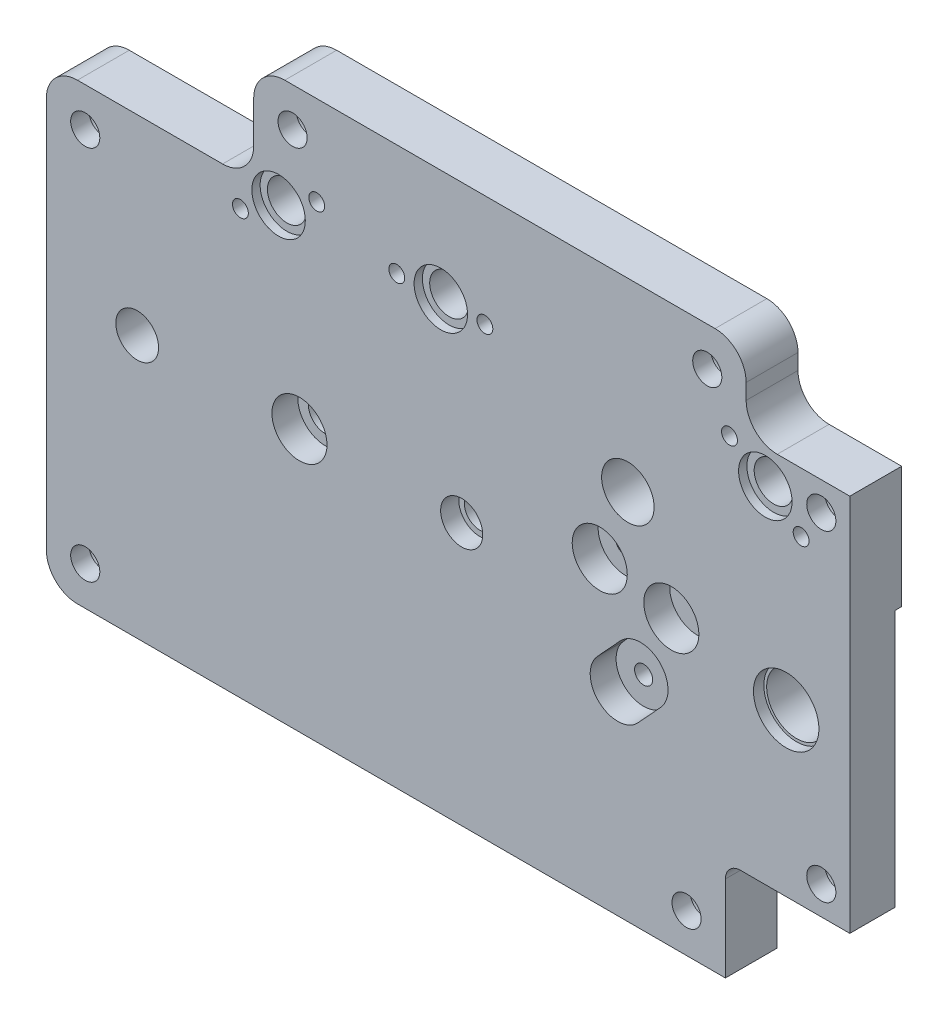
ISO-10303-21;
HEADER;
FILE_DESCRIPTION(('STEP AP214'),'2;1');
FILE_NAME('part.step','',(''),(''),'','','');
FILE_SCHEMA(('AUTOMOTIVE_DESIGN { 1 0 10303 214 1 1 1 1 }'));
ENDSEC;
DATA;
#1=APPLICATION_CONTEXT('core data for automotive mechanical design processes');
#2=APPLICATION_PROTOCOL_DEFINITION('international standard','automotive_design',2000,#1);
#3=PRODUCT_CONTEXT('',#1,'mechanical');
#4=PRODUCT('Part','Part','',(#3));
#5=PRODUCT_RELATED_PRODUCT_CATEGORY('part','',(#4));
#6=PRODUCT_DEFINITION_FORMATION('','',#4);
#7=PRODUCT_DEFINITION_CONTEXT('part definition',#1,'design');
#8=PRODUCT_DEFINITION('design','',#6,#7);
#9=PRODUCT_DEFINITION_SHAPE('','',#8);
#10=(LENGTH_UNIT() NAMED_UNIT(*) SI_UNIT(.MILLI.,.METRE.));
#11=(NAMED_UNIT(*) PLANE_ANGLE_UNIT() SI_UNIT($,.RADIAN.));
#12=(NAMED_UNIT(*) SI_UNIT($,.STERADIAN.) SOLID_ANGLE_UNIT());
#13=UNCERTAINTY_MEASURE_WITH_UNIT(LENGTH_MEASURE(1.E-05),#10,'distance_accuracy_value','');
#14=(GEOMETRIC_REPRESENTATION_CONTEXT(3) GLOBAL_UNCERTAINTY_ASSIGNED_CONTEXT((#13)) GLOBAL_UNIT_ASSIGNED_CONTEXT((#10,
#11,#12)) REPRESENTATION_CONTEXT('',''));
#15=CARTESIAN_POINT('',(0.,0.,0.));
#16=DIRECTION('',(0.,0.,1.));
#17=DIRECTION('',(1.,0.,0.));
#18=AXIS2_PLACEMENT_3D('',#15,#16,#17);
#19=CARTESIAN_POINT('',(-796.778000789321,-41.1769872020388,15.8999999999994));
#20=DIRECTION('',(0.,0.,1.));
#21=DIRECTION('',(1.,0.,0.));
#22=AXIS2_PLACEMENT_3D('',#19,#20,#21);
#23=CYLINDRICAL_SURFACE('',#22,6.74687500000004);
#24=DIRECTION('',(0.,0.,1.));
#25=VECTOR('',#24,1.);
#26=CARTESIAN_POINT('',(-791.811809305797,-45.7439626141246,9.54999999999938));
#27=LINE('',#26,#25);
#28=CARTESIAN_POINT('',(-791.811809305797,-45.7439626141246,9.54999999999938));
#29=VERTEX_POINT('',#28);
#30=CARTESIAN_POINT('',(-791.811809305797,-45.7439626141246,15.8999999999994));
#31=VERTEX_POINT('',#30);
#32=EDGE_CURVE('E247',#29,#31,#27,.T.);
#33=ORIENTED_EDGE('',*,*,#32,.T.);
#34=CARTESIAN_POINT('',(-796.778000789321,-41.1769872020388,15.8999999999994));
#35=DIRECTION('',(0.,0.,-1.));
#36=DIRECTION('',(-1.,0.,0.));
#37=AXIS2_PLACEMENT_3D('',#34,#35,#36);
#38=CIRCLE('',#37,6.74687500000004);
#39=CARTESIAN_POINT('',(-801.744192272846,-36.6100117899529,15.8999999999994));
#40=VERTEX_POINT('',#39);
#41=EDGE_CURVE('E245',#40,#31,#38,.T.);
#42=ORIENTED_EDGE('',*,*,#41,.F.);
#43=DIRECTION('',(0.,0.,1.));
#44=VECTOR('',#43,1.);
#45=CARTESIAN_POINT('',(-801.744192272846,-36.6100117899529,9.54999999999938));
#46=LINE('',#45,#44);
#47=CARTESIAN_POINT('',(-801.744192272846,-36.6100117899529,9.54999999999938));
#48=VERTEX_POINT('',#47);
#49=EDGE_CURVE('E239',#48,#40,#46,.T.);
#50=ORIENTED_EDGE('',*,*,#49,.F.);
#51=CARTESIAN_POINT('',(-796.778000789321,-41.1769872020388,9.54999999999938));
#52=DIRECTION('',(0.,0.,1.));
#53=DIRECTION('',(1.,0.,0.));
#54=AXIS2_PLACEMENT_3D('',#51,#52,#53);
#55=CIRCLE('',#54,6.74687500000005);
#56=EDGE_CURVE('E242',#29,#48,#55,.T.);
#57=ORIENTED_EDGE('',*,*,#56,.F.);
#58=EDGE_LOOP('',(#33,#42,#50,#57));
#59=FACE_BOUND('',#58,.T.);
#60=ADVANCED_FACE('F48',(#59),#23,.F.);
#61=CARTESIAN_POINT('',(-796.778000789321,-41.1769872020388,15.8999999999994));
#62=DIRECTION('',(0.,0.,1.));
#63=DIRECTION('',(1.,0.,0.));
#64=AXIS2_PLACEMENT_3D('',#61,#62,#63);
#65=CYLINDRICAL_SURFACE('',#64,2.21868999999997);
#66=CARTESIAN_POINT('',(-796.778000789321,-41.1769872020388,4.79986188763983));
#67=DIRECTION('',(0.,0.,-1.));
#68=DIRECTION('',(-1.,0.,0.));
#69=AXIS2_PLACEMENT_3D('',#66,#67,#68);
#70=CIRCLE('',#69,2.21868999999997);
#71=CARTESIAN_POINT('',(-798.996690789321,-41.1769872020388,4.79986188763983));
#72=VERTEX_POINT('',#71);
#73=EDGE_CURVE('E283',#72,#72,#70,.T.);
#74=ORIENTED_EDGE('',*,*,#73,.T.);
#75=EDGE_LOOP('',(#74));
#76=FACE_BOUND('',#75,.T.);
#77=CARTESIAN_POINT('',(-796.778000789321,-41.1769872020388,9.54999999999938));
#78=DIRECTION('',(0.,0.,1.));
#79=DIRECTION('',(1.,0.,0.));
#80=AXIS2_PLACEMENT_3D('',#77,#78,#79);
#81=CIRCLE('',#80,2.21868999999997);
#82=CARTESIAN_POINT('',(-794.559310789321,-41.1769872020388,9.54999999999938));
#83=VERTEX_POINT('',#82);
#84=EDGE_CURVE('E778',#83,#83,#81,.F.);
#85=ORIENTED_EDGE('',*,*,#84,.F.);
#86=EDGE_LOOP('',(#85));
#87=FACE_BOUND('',#86,.T.);
#88=ADVANCED_FACE('F1597',(#76,#87),#65,.F.);
#89=CARTESIAN_POINT('',(-802.354782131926,-47.2412554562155,15.8999999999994));
#90=DIRECTION('',(0.,0.,1.));
#91=DIRECTION('',(1.,0.,0.));
#92=AXIS2_PLACEMENT_3D('',#89,#90,#91);
#93=CYLINDRICAL_SURFACE('',#92,6.74687500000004);
#94=CARTESIAN_POINT('',(-802.354782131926,-47.2412554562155,15.8999999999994));
#95=DIRECTION('',(0.,0.,-1.));
#96=DIRECTION('',(-1.,0.,0.));
#97=AXIS2_PLACEMENT_3D('',#94,#95,#96);
#98=CIRCLE('',#97,6.74687500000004);
#99=CARTESIAN_POINT('',(-797.388590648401,-51.8082308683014,15.8999999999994));
#100=VERTEX_POINT('',#99);
#101=CARTESIAN_POINT('',(-807.32097361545,-42.6742800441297,15.8999999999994));
#102=VERTEX_POINT('',#101);
#103=EDGE_CURVE('E299',#100,#102,#98,.T.);
#104=ORIENTED_EDGE('',*,*,#103,.F.);
#105=DIRECTION('',(0.,0.,1.));
#106=VECTOR('',#105,1.);
#107=CARTESIAN_POINT('',(-797.388590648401,-51.8082308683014,15.8999999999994));
#108=LINE('',#107,#106);
#109=CARTESIAN_POINT('',(-797.388590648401,-51.8082308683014,9.54999999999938));
#110=VERTEX_POINT('',#109);
#111=EDGE_CURVE('E12',#100,#110,#108,.F.);
#112=ORIENTED_EDGE('',*,*,#111,.T.);
#113=CARTESIAN_POINT('',(-802.354782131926,-47.2412554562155,9.54999999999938));
#114=DIRECTION('',(0.,0.,1.));
#115=DIRECTION('',(1.,0.,0.));
#116=AXIS2_PLACEMENT_3D('',#113,#114,#115);
#117=CIRCLE('',#116,6.74687500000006);
#118=CARTESIAN_POINT('',(-807.32097361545,-42.6742800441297,9.54999999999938));
#119=VERTEX_POINT('',#118);
#120=EDGE_CURVE('E257',#119,#110,#117,.T.);
#121=ORIENTED_EDGE('',*,*,#120,.F.);
#122=DIRECTION('',(0.,0.,1.));
#123=VECTOR('',#122,1.);
#124=CARTESIAN_POINT('',(-807.32097361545,-42.6742800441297,15.8999999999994));
#125=LINE('',#124,#123);
#126=EDGE_CURVE('E57',#102,#119,#125,.F.);
#127=ORIENTED_EDGE('',*,*,#126,.F.);
#128=EDGE_LOOP('',(#104,#112,#121,#127));
#129=FACE_BOUND('',#128,.T.);
#130=ADVANCED_FACE('F1589',(#129),#93,.F.);
#131=CARTESIAN_POINT('',(-802.354782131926,-47.2412554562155,15.8999999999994));
#132=DIRECTION('',(0.,0.,1.));
#133=DIRECTION('',(1.,0.,0.));
#134=AXIS2_PLACEMENT_3D('',#131,#132,#133);
#135=CYLINDRICAL_SURFACE('',#134,2.21868999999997);
#136=CARTESIAN_POINT('',(-802.354782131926,-47.2412554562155,4.79986188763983));
#137=DIRECTION('',(0.,0.,-1.));
#138=DIRECTION('',(-1.,0.,0.));
#139=AXIS2_PLACEMENT_3D('',#136,#137,#138);
#140=CIRCLE('',#139,2.21868999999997);
#141=CARTESIAN_POINT('',(-804.573472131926,-47.2412554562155,4.79986188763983));
#142=VERTEX_POINT('',#141);
#143=EDGE_CURVE('E292',#142,#142,#140,.T.);
#144=ORIENTED_EDGE('',*,*,#143,.T.);
#145=EDGE_LOOP('',(#144));
#146=FACE_BOUND('',#145,.T.);
#147=CARTESIAN_POINT('',(-802.354782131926,-47.2412554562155,9.54999999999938));
#148=DIRECTION('',(0.,0.,1.));
#149=DIRECTION('',(1.,0.,0.));
#150=AXIS2_PLACEMENT_3D('',#147,#148,#149);
#151=CIRCLE('',#150,2.21868999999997);
#152=CARTESIAN_POINT('',(-800.136092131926,-47.2412554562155,9.54999999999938));
#153=VERTEX_POINT('',#152);
#154=EDGE_CURVE('E760',#153,#153,#151,.F.);
#155=ORIENTED_EDGE('',*,*,#154,.F.);
#156=EDGE_LOOP('',(#155));
#157=FACE_BOUND('',#156,.T.);
#158=ADVANCED_FACE('F1587',(#146,#157),#135,.F.);
#159=CARTESIAN_POINT('',(-745.49,22.225,15.8999999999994));
#160=DIRECTION('',(1.,0.,0.));
#161=DIRECTION('',(0.,0.,-1.));
#162=AXIS2_PLACEMENT_3D('',#159,#160,#161);
#163=PLANE('',#162);
#164=DIRECTION('',(0.,0.,1.));
#165=VECTOR('',#164,1.);
#166=CARTESIAN_POINT('',(-745.49,-70.5484788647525,15.8999999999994));
#167=LINE('',#166,#165);
#168=CARTESIAN_POINT('',(-745.49,-70.5484788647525,4.79986188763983));
#169=VERTEX_POINT('',#168);
#170=CARTESIAN_POINT('',(-745.49,-70.5484788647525,15.8999999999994));
#171=VERTEX_POINT('',#170);
#172=EDGE_CURVE('E1369',#169,#171,#167,.T.);
#173=ORIENTED_EDGE('',*,*,#172,.F.);
#174=DIRECTION('',(0.,-1.,0.));
#175=VECTOR('',#174,1.);
#176=CARTESIAN_POINT('',(-745.49,-7.56784021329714,4.79986188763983));
#177=LINE('',#176,#175);
#178=CARTESIAN_POINT('',(-745.49,-7.56784021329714,4.79986188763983));
#179=VERTEX_POINT('',#178);
#180=EDGE_CURVE('E1156',#179,#169,#177,.T.);
#181=ORIENTED_EDGE('',*,*,#180,.F.);
#182=DIRECTION('',(0.,0.,1.));
#183=VECTOR('',#182,1.);
#184=CARTESIAN_POINT('',(-745.49,-7.56784021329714,3.19999999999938));
#185=LINE('',#184,#183);
#186=CARTESIAN_POINT('',(-745.49,-7.56784021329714,3.19999999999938));
#187=VERTEX_POINT('',#186);
#188=EDGE_CURVE('E1171',#187,#179,#185,.T.);
#189=ORIENTED_EDGE('',*,*,#188,.F.);
#190=DIRECTION('',(0.,-1.,0.));
#191=VECTOR('',#190,1.);
#192=CARTESIAN_POINT('',(-745.49,22.225,3.19999999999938));
#193=LINE('',#192,#191);
#194=CARTESIAN_POINT('',(-745.49,22.225,3.19999999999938));
#195=VERTEX_POINT('',#194);
#196=EDGE_CURVE('E811',#195,#187,#193,.T.);
#197=ORIENTED_EDGE('',*,*,#196,.F.);
#198=DIRECTION('',(0.,0.,-1.));
#199=VECTOR('',#198,1.);
#200=CARTESIAN_POINT('',(-745.49,22.225,15.8999999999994));
#201=LINE('',#200,#199);
#202=CARTESIAN_POINT('',(-745.49,22.225,15.8999999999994));
#203=VERTEX_POINT('',#202);
#204=EDGE_CURVE('E816',#203,#195,#201,.T.);
#205=ORIENTED_EDGE('',*,*,#204,.F.);
#206=DIRECTION('',(0.,-1.,0.));
#207=VECTOR('',#206,1.);
#208=CARTESIAN_POINT('',(-745.49,22.225,15.8999999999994));
#209=LINE('',#208,#207);
#210=EDGE_CURVE('E883',#203,#171,#209,.T.);
#211=ORIENTED_EDGE('',*,*,#210,.T.);
#212=EDGE_LOOP('',(#173,#181,#189,#197,#205,#211));
#213=FACE_BOUND('',#212,.T.);
#214=ADVANCED_FACE('F1374',(#213),#163,.T.);
#215=CARTESIAN_POINT('',(-942.34,8.255,15.8999999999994));
#216=DIRECTION('',(-1.,0.,0.));
#217=DIRECTION('',(0.,-1.,0.));
#218=AXIS2_PLACEMENT_3D('',#215,#216,#217);
#219=PLANE('',#218);
#220=DIRECTION('',(0.,1.,0.));
#221=VECTOR('',#220,1.);
#222=CARTESIAN_POINT('',(-942.34,8.255,3.19999999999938));
#223=LINE('',#222,#221);
#224=CARTESIAN_POINT('',(-942.34,-7.56784021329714,3.19999999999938));
#225=VERTEX_POINT('',#224);
#226=CARTESIAN_POINT('',(-942.34,8.255,3.19999999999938));
#227=VERTEX_POINT('',#226);
#228=EDGE_CURVE('E1243',#225,#227,#223,.T.);
#229=ORIENTED_EDGE('',*,*,#228,.F.);
#230=DIRECTION('',(0.,0.,1.));
#231=VECTOR('',#230,1.);
#232=CARTESIAN_POINT('',(-942.34,-7.56784021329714,15.8999999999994));
#233=LINE('',#232,#231);
#234=CARTESIAN_POINT('',(-942.34,-7.56784021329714,4.79986188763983));
#235=VERTEX_POINT('',#234);
#236=EDGE_CURVE('E1178',#225,#235,#233,.T.);
#237=ORIENTED_EDGE('',*,*,#236,.T.);
#238=DIRECTION('',(0.,-1.,0.));
#239=VECTOR('',#238,1.);
#240=CARTESIAN_POINT('',(-942.34,8.255,4.79986188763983));
#241=LINE('',#240,#239);
#242=CARTESIAN_POINT('',(-942.34,-75.7668402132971,4.79986188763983));
#243=VERTEX_POINT('',#242);
#244=EDGE_CURVE('E887',#235,#243,#241,.T.);
#245=ORIENTED_EDGE('',*,*,#244,.T.);
#246=DIRECTION('',(0.,0.,-1.));
#247=VECTOR('',#246,1.);
#248=CARTESIAN_POINT('',(-942.34,-75.7668402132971,15.8999999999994));
#249=LINE('',#248,#247);
#250=CARTESIAN_POINT('',(-942.34,-75.7668402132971,3.19999999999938));
#251=VERTEX_POINT('',#250);
#252=EDGE_CURVE('E1174',#243,#251,#249,.T.);
#253=ORIENTED_EDGE('',*,*,#252,.T.);
#254=CARTESIAN_POINT('',(-942.34,-87.63,3.19999999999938));
#255=VERTEX_POINT('',#254);
#256=EDGE_CURVE('E1244',#255,#251,#223,.T.);
#257=ORIENTED_EDGE('',*,*,#256,.F.);
#258=DIRECTION('',(0.,0.,-1.));
#259=VECTOR('',#258,1.);
#260=CARTESIAN_POINT('',(-942.34,-87.63,15.8999999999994));
#261=LINE('',#260,#259);
#262=CARTESIAN_POINT('',(-942.34,-87.63,15.8999999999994));
#263=VERTEX_POINT('',#262);
#264=EDGE_CURVE('E876',#263,#255,#261,.T.);
#265=ORIENTED_EDGE('',*,*,#264,.F.);
#266=DIRECTION('',(0.,1.,0.));
#267=VECTOR('',#266,1.);
#268=CARTESIAN_POINT('',(-942.34,8.255,15.8999999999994));
#269=LINE('',#268,#267);
#270=CARTESIAN_POINT('',(-942.34,8.255,15.8999999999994));
#271=VERTEX_POINT('',#270);
#272=EDGE_CURVE('E1189',#263,#271,#269,.T.);
#273=ORIENTED_EDGE('',*,*,#272,.T.);
#274=DIRECTION('',(0.,0.,-1.));
#275=VECTOR('',#274,1.);
#276=CARTESIAN_POINT('',(-942.34,8.255,15.8999999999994));
#277=LINE('',#276,#275);
#278=EDGE_CURVE('E872',#271,#227,#277,.T.);
#279=ORIENTED_EDGE('',*,*,#278,.T.);
#280=EDGE_LOOP('',(#229,#237,#245,#253,#257,#265,#273,#279));
#281=FACE_BOUND('',#280,.T.);
#282=ADVANCED_FACE('F1266',(#281),#219,.T.);
#283=CARTESIAN_POINT('',(-934.72,-87.63,3.19999999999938));
#284=DIRECTION('',(0.,0.,-1.));
#285=DIRECTION('',(-1.,0.,0.));
#286=AXIS2_PLACEMENT_3D('',#283,#284,#285);
#287=PLANE('',#286);
#288=CARTESIAN_POINT('',(-774.963612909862,20.2607303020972,3.19999999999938));
#289=DIRECTION('',(0.,0.,1.));
#290=DIRECTION('',(1.,0.,0.));
#291=AXIS2_PLACEMENT_3D('',#288,#289,#290);
#292=CIRCLE('',#291,0.793750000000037);
#293=CARTESIAN_POINT('',(-774.169862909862,20.2607303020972,3.19999999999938));
#294=VERTEX_POINT('',#293);
#295=EDGE_CURVE('E772',#294,#294,#292,.T.);
#296=ORIENTED_EDGE('',*,*,#295,.T.);
#297=EDGE_LOOP('',(#296));
#298=FACE_BOUND('',#297,.T.);
#299=CARTESIAN_POINT('',(-894.792744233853,8.57249999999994,3.19999999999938));
#300=DIRECTION('',(0.,0.,1.));
#301=DIRECTION('',(1.,0.,0.));
#302=AXIS2_PLACEMENT_3D('',#299,#300,#301);
#303=CIRCLE('',#302,0.793750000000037);
#304=CARTESIAN_POINT('',(-893.998994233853,8.57249999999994,3.19999999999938));
#305=VERTEX_POINT('',#304);
#306=EDGE_CURVE('E743',#305,#305,#303,.T.);
#307=ORIENTED_EDGE('',*,*,#306,.T.);
#308=EDGE_LOOP('',(#307));
#309=FACE_BOUND('',#308,.T.);
#310=CARTESIAN_POINT('',(-757.418387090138,7.67926969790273,3.19999999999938));
#311=DIRECTION('',(0.,0.,1.));
#312=DIRECTION('',(1.,0.,0.));
#313=AXIS2_PLACEMENT_3D('',#310,#311,#312);
#314=CIRCLE('',#313,0.793750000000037);
#315=CARTESIAN_POINT('',(-756.624637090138,7.67926969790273,3.19999999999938));
#316=VERTEX_POINT('',#315);
#317=EDGE_CURVE('E718',#316,#316,#314,.T.);
#318=ORIENTED_EDGE('',*,*,#317,.T.);
#319=EDGE_LOOP('',(#318));
#320=FACE_BOUND('',#319,.T.);
#321=CARTESIAN_POINT('',(-834.898,13.97,3.19999999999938));
#322=DIRECTION('',(0.,0.,1.));
#323=DIRECTION('',(1.,0.,0.));
#324=AXIS2_PLACEMENT_3D('',#321,#322,#323);
#325=CIRCLE('',#324,0.793750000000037);
#326=CARTESIAN_POINT('',(-834.10425,13.97,3.19999999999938));
#327=VERTEX_POINT('',#326);
#328=EDGE_CURVE('E694',#327,#327,#325,.T.);
#329=ORIENTED_EDGE('',*,*,#328,.T.);
#330=EDGE_LOOP('',(#329));
#331=FACE_BOUND('',#330,.T.);
#332=CARTESIAN_POINT('',(-876.095255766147,19.3675,3.19999999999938));
#333=DIRECTION('',(0.,0.,1.));
#334=DIRECTION('',(1.,0.,0.));
#335=AXIS2_PLACEMENT_3D('',#332,#333,#334);
#336=CIRCLE('',#335,0.793750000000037);
#337=CARTESIAN_POINT('',(-875.301505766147,19.3675,3.19999999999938));
#338=VERTEX_POINT('',#337);
#339=EDGE_CURVE('E1534',#338,#338,#336,.T.);
#340=ORIENTED_EDGE('',*,*,#339,.T.);
#341=EDGE_LOOP('',(#340));
#342=FACE_BOUND('',#341,.T.);
#343=CARTESIAN_POINT('',(-856.488,13.97,3.19999999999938));
#344=DIRECTION('',(0.,0.,1.));
#345=DIRECTION('',(1.,0.,0.));
#346=AXIS2_PLACEMENT_3D('',#343,#344,#345);
#347=CIRCLE('',#346,0.793750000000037);
#348=CARTESIAN_POINT('',(-855.69425,13.97,3.19999999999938));
#349=VERTEX_POINT('',#348);
#350=EDGE_CURVE('E651',#349,#349,#347,.T.);
#351=ORIENTED_EDGE('',*,*,#350,.T.);
#352=EDGE_LOOP('',(#351));
#353=FACE_BOUND('',#352,.T.);
#354=CARTESIAN_POINT('',(-932.815,6.35,3.19999999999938));
#355=DIRECTION('',(0.,0.,-1.));
#356=DIRECTION('',(-1.,0.,0.));
#357=AXIS2_PLACEMENT_3D('',#354,#355,#356);
#358=CIRCLE('',#357,5.35940000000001);
#359=CARTESIAN_POINT('',(-938.1744,6.35,3.19999999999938));
#360=VERTEX_POINT('',#359);
#361=EDGE_CURVE('E602',#360,#360,#358,.T.);
#362=ORIENTED_EDGE('',*,*,#361,.F.);
#363=EDGE_LOOP('',(#362));
#364=FACE_BOUND('',#363,.T.);
#365=CARTESIAN_POINT('',(-882.015,31.75,3.19999999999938));
#366=DIRECTION('',(0.,0.,-1.));
#367=DIRECTION('',(-1.,0.,0.));
#368=AXIS2_PLACEMENT_3D('',#365,#366,#367);
#369=CIRCLE('',#368,5.35940000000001);
#370=CARTESIAN_POINT('',(-887.3744,31.75,3.19999999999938));
#371=VERTEX_POINT('',#370);
#372=EDGE_CURVE('E572',#371,#371,#369,.T.);
#373=ORIENTED_EDGE('',*,*,#372,.F.);
#374=EDGE_LOOP('',(#373));
#375=FACE_BOUND('',#374,.T.);
#376=CARTESIAN_POINT('',(-780.415,31.75,3.19999999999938));
#377=DIRECTION('',(0.,0.,-1.));
#378=DIRECTION('',(-1.,0.,0.));
#379=AXIS2_PLACEMENT_3D('',#376,#377,#378);
#380=CIRCLE('',#379,5.35940000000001);
#381=CARTESIAN_POINT('',(-785.7744,31.75,3.19999999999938));
#382=VERTEX_POINT('',#381);
#383=EDGE_CURVE('E543',#382,#382,#380,.T.);
#384=ORIENTED_EDGE('',*,*,#383,.F.);
#385=EDGE_LOOP('',(#384));
#386=FACE_BOUND('',#385,.T.);
#387=CARTESIAN_POINT('',(-752.475,15.24,3.19999999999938));
#388=DIRECTION('',(0.,0.,-1.));
#389=DIRECTION('',(-1.,0.,0.));
#390=AXIS2_PLACEMENT_3D('',#387,#388,#389);
#391=CIRCLE('',#390,5.35940000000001);
#392=CARTESIAN_POINT('',(-757.8344,15.24,3.19999999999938));
#393=VERTEX_POINT('',#392);
#394=EDGE_CURVE('E455',#393,#393,#391,.T.);
#395=ORIENTED_EDGE('',*,*,#394,.F.);
#396=EDGE_LOOP('',(#395));
#397=FACE_BOUND('',#396,.T.);
#398=CARTESIAN_POINT('',(-766.191,13.97,3.19999999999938));
#399=DIRECTION('',(0.,0.,1.));
#400=DIRECTION('',(1.,0.,0.));
#401=AXIS2_PLACEMENT_3D('',#398,#399,#400);
#402=CIRCLE('',#401,4.7625);
#403=CARTESIAN_POINT('',(-761.4285,13.97,3.19999999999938));
#404=VERTEX_POINT('',#403);
#405=EDGE_CURVE('E377',#404,#404,#402,.T.);
#406=ORIENTED_EDGE('',*,*,#405,.T.);
#407=EDGE_LOOP('',(#406));
#408=FACE_BOUND('',#407,.T.);
#409=CARTESIAN_POINT('',(-845.693,13.97,3.19999999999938));
#410=DIRECTION('',(0.,0.,1.));
#411=DIRECTION('',(1.,0.,0.));
#412=AXIS2_PLACEMENT_3D('',#409,#410,#411);
#413=CIRCLE('',#412,4.7625);
#414=CARTESIAN_POINT('',(-840.9305,13.97,3.19999999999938));
#415=VERTEX_POINT('',#414);
#416=EDGE_CURVE('E350',#415,#415,#413,.T.);
#417=ORIENTED_EDGE('',*,*,#416,.T.);
#418=EDGE_LOOP('',(#417));
#419=FACE_BOUND('',#418,.T.);
#420=CARTESIAN_POINT('',(-885.444,13.97,3.19999999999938));
#421=DIRECTION('',(0.,0.,1.));
#422=DIRECTION('',(1.,0.,0.));
#423=AXIS2_PLACEMENT_3D('',#420,#421,#422);
#424=CIRCLE('',#423,4.7625);
#425=CARTESIAN_POINT('',(-880.6815,13.97,3.19999999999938));
#426=VERTEX_POINT('',#425);
#427=EDGE_CURVE('E330',#426,#426,#424,.T.);
#428=ORIENTED_EDGE('',*,*,#427,.T.);
#429=EDGE_LOOP('',(#428));
#430=FACE_BOUND('',#429,.T.);
#431=CARTESIAN_POINT('',(-800.276606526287,-4.8861439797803,3.19999999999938));
#432=DIRECTION('',(0.,0.,1.));
#433=DIRECTION('',(1.,0.,0.));
#434=AXIS2_PLACEMENT_3D('',#431,#432,#433);
#435=CIRCLE('',#434,1.74310999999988);
#436=CARTESIAN_POINT('',(-801.823354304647,-4.08240037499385,3.19999999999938));
#437=VERTEX_POINT('',#436);
#438=CARTESIAN_POINT('',(-798.729858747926,-5.68988758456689,3.19999999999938));
#439=VERTEX_POINT('',#438);
#440=EDGE_CURVE('E1015',#437,#439,#435,.T.);
#441=ORIENTED_EDGE('',*,*,#440,.T.);
#442=DIRECTION('',(0.46109746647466,0.887349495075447,0.));
#443=VECTOR('',#442,1.);
#444=CARTESIAN_POINT('',(-798.729858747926,-5.68988758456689,3.19999999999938));
#445=LINE('',#444,#443);
#446=CARTESIAN_POINT('',(-797.922938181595,-4.13702596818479,3.19999999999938));
#447=VERTEX_POINT('',#446);
#448=EDGE_CURVE('E1012',#439,#447,#445,.T.);
#449=ORIENTED_EDGE('',*,*,#448,.T.);
#450=CARTESIAN_POINT('',(-799.469685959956,-3.33328236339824,3.19999999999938));
#451=DIRECTION('',(0.,0.,1.));
#452=DIRECTION('',(1.,0.,0.));
#453=AXIS2_PLACEMENT_3D('',#450,#451,#452);
#454=CIRCLE('',#453,1.74310999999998);
#455=CARTESIAN_POINT('',(-801.016433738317,-2.52953875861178,3.19999999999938));
#456=VERTEX_POINT('',#455);
#457=EDGE_CURVE('E1007',#447,#456,#454,.T.);
#458=ORIENTED_EDGE('',*,*,#457,.T.);
#459=DIRECTION('',(-0.461097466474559,-0.887349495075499,0.));
#460=VECTOR('',#459,1.);
#461=CARTESIAN_POINT('',(-801.016433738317,-2.52953875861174,3.19999999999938));
#462=LINE('',#461,#460);
#463=EDGE_CURVE('E963',#456,#437,#462,.T.);
#464=ORIENTED_EDGE('',*,*,#463,.T.);
#465=EDGE_LOOP('',(#441,#449,#458,#464));
#466=FACE_BOUND('',#465,.T.);
#467=ORIENTED_EDGE('',*,*,#196,.T.);
#468=DIRECTION('',(-1.,0.,0.));
#469=VECTOR('',#468,1.);
#470=CARTESIAN_POINT('',(-934.72,-7.56784021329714,3.19999999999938));
#471=LINE('',#470,#469);
#472=EDGE_CURVE('E819',#187,#225,#471,.T.);
#473=ORIENTED_EDGE('',*,*,#472,.T.);
#474=ORIENTED_EDGE('',*,*,#228,.T.);
#475=CARTESIAN_POINT('',(-934.72,8.255,3.19999999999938));
#476=DIRECTION('',(0.,0.,-1.));
#477=DIRECTION('',(1.,0.,0.));
#478=AXIS2_PLACEMENT_3D('',#475,#476,#477);
#479=CIRCLE('',#478,7.61999999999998);
#480=CARTESIAN_POINT('',(-934.72,15.875,3.19999999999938));
#481=VERTEX_POINT('',#480);
#482=EDGE_CURVE('E1246',#227,#481,#479,.T.);
#483=ORIENTED_EDGE('',*,*,#482,.T.);
#484=DIRECTION('',(1.,0.,0.));
#485=VECTOR('',#484,1.);
#486=CARTESIAN_POINT('',(-899.16,15.875,3.19999999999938));
#487=LINE('',#486,#485);
#488=CARTESIAN_POINT('',(-899.16,15.875,3.19999999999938));
#489=VERTEX_POINT('',#488);
#490=EDGE_CURVE('E854',#481,#489,#487,.T.);
#491=ORIENTED_EDGE('',*,*,#490,.T.);
#492=CARTESIAN_POINT('',(-899.16,23.495,3.19999999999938));
#493=DIRECTION('',(0.,0.,1.));
#494=DIRECTION('',(-1.,0.,0.));
#495=AXIS2_PLACEMENT_3D('',#492,#493,#494);
#496=CIRCLE('',#495,7.61999999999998);
#497=CARTESIAN_POINT('',(-891.54,23.4950000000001,3.19999999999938));
#498=VERTEX_POINT('',#497);
#499=EDGE_CURVE('E849',#489,#498,#496,.T.);
#500=ORIENTED_EDGE('',*,*,#499,.T.);
#501=DIRECTION('',(0.,1.,0.));
#502=VECTOR('',#501,1.);
#503=CARTESIAN_POINT('',(-891.54,33.655,3.19999999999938));
#504=LINE('',#503,#502);
#505=CARTESIAN_POINT('',(-891.54,33.655,3.19999999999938));
#506=VERTEX_POINT('',#505);
#507=EDGE_CURVE('E845',#498,#506,#504,.T.);
#508=ORIENTED_EDGE('',*,*,#507,.T.);
#509=CARTESIAN_POINT('',(-883.92,33.655,3.19999999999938));
#510=DIRECTION('',(0.,0.,-1.));
#511=DIRECTION('',(-1.,0.,0.));
#512=AXIS2_PLACEMENT_3D('',#509,#510,#511);
#513=CIRCLE('',#512,7.61999999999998);
#514=CARTESIAN_POINT('',(-883.92,41.275,3.19999999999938));
#515=VERTEX_POINT('',#514);
#516=EDGE_CURVE('E840',#506,#515,#513,.T.);
#517=ORIENTED_EDGE('',*,*,#516,.T.);
#518=DIRECTION('',(1.,0.,0.));
#519=VECTOR('',#518,1.);
#520=CARTESIAN_POINT('',(-778.51,41.275,3.19999999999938));
#521=LINE('',#520,#519);
#522=CARTESIAN_POINT('',(-778.51,41.275,3.19999999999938));
#523=VERTEX_POINT('',#522);
#524=EDGE_CURVE('E837',#515,#523,#521,.T.);
#525=ORIENTED_EDGE('',*,*,#524,.T.);
#526=CARTESIAN_POINT('',(-778.51,33.655,3.19999999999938));
#527=DIRECTION('',(0.,0.,-1.));
#528=DIRECTION('',(1.,0.,0.));
#529=AXIS2_PLACEMENT_3D('',#526,#527,#528);
#530=CIRCLE('',#529,7.61999999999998);
#531=CARTESIAN_POINT('',(-770.89,33.655,3.19999999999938));
#532=VERTEX_POINT('',#531);
#533=EDGE_CURVE('E832',#523,#532,#530,.T.);
#534=ORIENTED_EDGE('',*,*,#533,.T.);
#535=DIRECTION('',(0.,-1.,0.));
#536=VECTOR('',#535,1.);
#537=CARTESIAN_POINT('',(-770.89,29.8450000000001,3.19999999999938));
#538=LINE('',#537,#536);
#539=CARTESIAN_POINT('',(-770.89,29.845,3.19999999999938));
#540=VERTEX_POINT('',#539);
#541=EDGE_CURVE('E806',#532,#540,#538,.T.);
#542=ORIENTED_EDGE('',*,*,#541,.T.);
#543=CARTESIAN_POINT('',(-763.27,29.845,3.19999999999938));
#544=DIRECTION('',(0.,0.,1.));
#545=DIRECTION('',(-1.,0.,0.));
#546=AXIS2_PLACEMENT_3D('',#543,#544,#545);
#547=CIRCLE('',#546,7.61999999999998);
#548=CARTESIAN_POINT('',(-763.27,22.225,3.19999999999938));
#549=VERTEX_POINT('',#548);
#550=EDGE_CURVE('E799',#540,#549,#547,.T.);
#551=ORIENTED_EDGE('',*,*,#550,.T.);
#552=DIRECTION('',(1.,0.,0.));
#553=VECTOR('',#552,1.);
#554=CARTESIAN_POINT('',(-745.49,22.225,3.19999999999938));
#555=LINE('',#554,#553);
#556=EDGE_CURVE('E805',#549,#195,#555,.T.);
#557=ORIENTED_EDGE('',*,*,#556,.T.);
#558=EDGE_LOOP('',(#467,#473,#474,#483,#491,#500,#508,#517,#525,#534,#542,#551,#557));
#559=FACE_BOUND('',#558,.T.);
#560=ADVANCED_FACE('F1264',(#298,#309,#320,#331,#342,#353,#364,#375,#386,#397,#408,#419,#430,
#466,#559),#287,.T.);
#561=CARTESIAN_POINT('',(-785.495,-85.725,3.19999999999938));
#562=DIRECTION('',(0.,0.,-1.));
#563=DIRECTION('',(-1.,0.,0.));
#564=AXIS2_PLACEMENT_3D('',#561,#562,#563);
#565=CIRCLE('',#564,5.35940000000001);
#566=CARTESIAN_POINT('',(-790.8544,-85.725,3.19999999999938));
#567=VERTEX_POINT('',#566);
#568=EDGE_CURVE('E514',#567,#567,#565,.T.);
#569=ORIENTED_EDGE('',*,*,#568,.F.);
#570=EDGE_LOOP('',(#569));
#571=FACE_BOUND('',#570,.T.);
#572=CARTESIAN_POINT('',(-932.815,-85.7249999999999,3.19999999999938));
#573=DIRECTION('',(0.,0.,-1.));
#574=DIRECTION('',(-1.,0.,0.));
#575=AXIS2_PLACEMENT_3D('',#572,#573,#574);
#576=CIRCLE('',#575,5.35940000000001);
#577=CARTESIAN_POINT('',(-938.1744,-85.7249999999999,3.19999999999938));
#578=VERTEX_POINT('',#577);
#579=EDGE_CURVE('E478',#578,#578,#576,.T.);
#580=ORIENTED_EDGE('',*,*,#579,.F.);
#581=EDGE_LOOP('',(#580));
#582=FACE_BOUND('',#581,.T.);
#583=DIRECTION('',(0.,-1.,0.));
#584=VECTOR('',#583,1.);
#585=CARTESIAN_POINT('',(-775.97,-74.2314788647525,3.19999999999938));
#586=LINE('',#585,#584);
#587=CARTESIAN_POINT('',(-775.97,-75.7668402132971,3.19999999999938));
#588=VERTEX_POINT('',#587);
#589=CARTESIAN_POINT('',(-775.97,-95.25,3.19999999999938));
#590=VERTEX_POINT('',#589);
#591=EDGE_CURVE('E1452',#588,#590,#586,.T.);
#592=ORIENTED_EDGE('',*,*,#591,.T.);
#593=DIRECTION('',(-1.,0.,0.));
#594=VECTOR('',#593,1.);
#595=CARTESIAN_POINT('',(-745.49,-95.25,3.19999999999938));
#596=LINE('',#595,#594);
#597=CARTESIAN_POINT('',(-934.72,-95.2499999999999,3.19999999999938));
#598=VERTEX_POINT('',#597);
#599=EDGE_CURVE('E1182',#590,#598,#596,.T.);
#600=ORIENTED_EDGE('',*,*,#599,.T.);
#601=CARTESIAN_POINT('',(-934.72,-87.63,3.19999999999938));
#602=DIRECTION('',(0.,0.,-1.));
#603=DIRECTION('',(-1.,0.,0.));
#604=AXIS2_PLACEMENT_3D('',#601,#602,#603);
#605=CIRCLE('',#604,7.61999999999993);
#606=EDGE_CURVE('E1238',#598,#255,#605,.T.);
#607=ORIENTED_EDGE('',*,*,#606,.T.);
#608=ORIENTED_EDGE('',*,*,#256,.T.);
#609=DIRECTION('',(-1.,0.,0.));
#610=VECTOR('',#609,1.);
#611=CARTESIAN_POINT('',(-745.49,-75.7668402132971,3.19999999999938));
#612=LINE('',#611,#610);
#613=EDGE_CURVE('E1167',#588,#251,#612,.T.);
#614=ORIENTED_EDGE('',*,*,#613,.F.);
#615=EDGE_LOOP('',(#592,#600,#607,#608,#614));
#616=FACE_BOUND('',#615,.T.);
#617=ADVANCED_FACE('F1634',(#571,#582,#616),#287,.T.);
#618=CARTESIAN_POINT('',(-745.49,-95.25,15.8999999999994));
#619=DIRECTION('',(0.,-1.,0.));
#620=DIRECTION('',(0.,0.,-1.));
#621=AXIS2_PLACEMENT_3D('',#618,#619,#620);
#622=PLANE('',#621);
#623=DIRECTION('',(0.,0.,-1.));
#624=VECTOR('',#623,1.);
#625=CARTESIAN_POINT('',(-775.97,-95.25,15.8999999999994));
#626=LINE('',#625,#624);
#627=CARTESIAN_POINT('',(-775.97,-95.25,15.8999999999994));
#628=VERTEX_POINT('',#627);
#629=EDGE_CURVE('E395',#628,#590,#626,.T.);
#630=ORIENTED_EDGE('',*,*,#629,.F.);
#631=DIRECTION('',(-1.,0.,0.));
#632=VECTOR('',#631,1.);
#633=CARTESIAN_POINT('',(-745.49,-95.25,15.8999999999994));
#634=LINE('',#633,#632);
#635=CARTESIAN_POINT('',(-934.72,-95.2499999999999,15.8999999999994));
#636=VERTEX_POINT('',#635);
#637=EDGE_CURVE('E815',#628,#636,#634,.T.);
#638=ORIENTED_EDGE('',*,*,#637,.T.);
#639=DIRECTION('',(0.,0.,-1.));
#640=VECTOR('',#639,1.);
#641=CARTESIAN_POINT('',(-934.72,-95.2499999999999,15.8999999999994));
#642=LINE('',#641,#640);
#643=EDGE_CURVE('E879',#636,#598,#642,.T.);
#644=ORIENTED_EDGE('',*,*,#643,.T.);
#645=ORIENTED_EDGE('',*,*,#599,.F.);
#646=EDGE_LOOP('',(#630,#638,#644,#645));
#647=FACE_BOUND('',#646,.T.);
#648=ADVANCED_FACE('F50',(#647),#622,.T.);
#649=CARTESIAN_POINT('',(-745.49,22.225,15.8999999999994));
#650=DIRECTION('',(0.,1.,0.));
#651=DIRECTION('',(0.,0.,1.));
#652=AXIS2_PLACEMENT_3D('',#649,#650,#651);
#653=PLANE('',#652);
#654=ORIENTED_EDGE('',*,*,#556,.F.);
#655=DIRECTION('',(0.,0.,-1.));
#656=VECTOR('',#655,1.);
#657=CARTESIAN_POINT('',(-763.27,22.225,15.8999999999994));
#658=LINE('',#657,#656);
#659=CARTESIAN_POINT('',(-763.27,22.225,15.8999999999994));
#660=VERTEX_POINT('',#659);
#661=EDGE_CURVE('E820',#660,#549,#658,.T.);
#662=ORIENTED_EDGE('',*,*,#661,.F.);
#663=DIRECTION('',(1.,0.,0.));
#664=VECTOR('',#663,1.);
#665=CARTESIAN_POINT('',(-745.49,22.225,15.8999999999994));
#666=LINE('',#665,#664);
#667=EDGE_CURVE('E1229',#660,#203,#666,.T.);
#668=ORIENTED_EDGE('',*,*,#667,.T.);
#669=ORIENTED_EDGE('',*,*,#204,.T.);
#670=EDGE_LOOP('',(#654,#662,#668,#669));
#671=FACE_BOUND('',#670,.T.);
#672=ADVANCED_FACE('F1637',(#671),#653,.T.);
#673=CARTESIAN_POINT('',(-763.27,29.845,15.8999999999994));
#674=DIRECTION('',(0.,0.,-1.));
#675=DIRECTION('',(-1.,0.,0.));
#676=AXIS2_PLACEMENT_3D('',#673,#674,#675);
#677=CYLINDRICAL_SURFACE('',#676,7.61999999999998);
#678=ORIENTED_EDGE('',*,*,#550,.F.);
#679=DIRECTION('',(0.,0.,-1.));
#680=VECTOR('',#679,1.);
#681=CARTESIAN_POINT('',(-770.89,29.845,15.8999999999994));
#682=LINE('',#681,#680);
#683=CARTESIAN_POINT('',(-770.89,29.845,15.8999999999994));
#684=VERTEX_POINT('',#683);
#685=EDGE_CURVE('E823',#684,#540,#682,.T.);
#686=ORIENTED_EDGE('',*,*,#685,.F.);
#687=CARTESIAN_POINT('',(-763.27,29.845,15.8999999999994));
#688=DIRECTION('',(0.,0.,1.));
#689=DIRECTION('',(-1.,0.,0.));
#690=AXIS2_PLACEMENT_3D('',#687,#688,#689);
#691=CIRCLE('',#690,7.61999999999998);
#692=EDGE_CURVE('E1224',#684,#660,#691,.T.);
#693=ORIENTED_EDGE('',*,*,#692,.T.);
#694=ORIENTED_EDGE('',*,*,#661,.T.);
#695=EDGE_LOOP('',(#678,#686,#693,#694));
#696=FACE_BOUND('',#695,.T.);
#697=ADVANCED_FACE('F1640',(#696),#677,.F.);
#698=CARTESIAN_POINT('',(-770.89,29.8450000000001,15.8999999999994));
#699=DIRECTION('',(1.,0.,0.));
#700=DIRECTION('',(0.,0.,-1.));
#701=AXIS2_PLACEMENT_3D('',#698,#699,#700);
#702=PLANE('',#701);
#703=ORIENTED_EDGE('',*,*,#541,.F.);
#704=DIRECTION('',(0.,0.,-1.));
#705=VECTOR('',#704,1.);
#706=CARTESIAN_POINT('',(-770.89,33.655,15.8999999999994));
#707=LINE('',#706,#705);
#708=CARTESIAN_POINT('',(-770.89,33.655,15.8999999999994));
#709=VERTEX_POINT('',#708);
#710=EDGE_CURVE('E1301',#709,#532,#707,.T.);
#711=ORIENTED_EDGE('',*,*,#710,.F.);
#712=DIRECTION('',(0.,-1.,0.));
#713=VECTOR('',#712,1.);
#714=CARTESIAN_POINT('',(-770.89,29.8450000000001,15.8999999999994));
#715=LINE('',#714,#713);
#716=EDGE_CURVE('E1221',#709,#684,#715,.T.);
#717=ORIENTED_EDGE('',*,*,#716,.T.);
#718=ORIENTED_EDGE('',*,*,#685,.T.);
#719=EDGE_LOOP('',(#703,#711,#717,#718));
#720=FACE_BOUND('',#719,.T.);
#721=ADVANCED_FACE('F1308',(#720),#702,.T.);
#722=CARTESIAN_POINT('',(-778.51,33.655,15.8999999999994));
#723=DIRECTION('',(0.,0.,-1.));
#724=DIRECTION('',(-1.,0.,0.));
#725=AXIS2_PLACEMENT_3D('',#722,#723,#724);
#726=CYLINDRICAL_SURFACE('',#725,7.61999999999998);
#727=ORIENTED_EDGE('',*,*,#533,.F.);
#728=DIRECTION('',(0.,0.,-1.));
#729=VECTOR('',#728,1.);
#730=CARTESIAN_POINT('',(-778.51,41.275,15.8999999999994));
#731=LINE('',#730,#729);
#732=CARTESIAN_POINT('',(-778.51,41.275,15.8999999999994));
#733=VERTEX_POINT('',#732);
#734=EDGE_CURVE('E1297',#733,#523,#731,.T.);
#735=ORIENTED_EDGE('',*,*,#734,.F.);
#736=CARTESIAN_POINT('',(-778.51,33.655,15.8999999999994));
#737=DIRECTION('',(0.,0.,-1.));
#738=DIRECTION('',(1.,0.,0.));
#739=AXIS2_PLACEMENT_3D('',#736,#737,#738);
#740=CIRCLE('',#739,7.61999999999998);
#741=EDGE_CURVE('E1217',#733,#709,#740,.T.);
#742=ORIENTED_EDGE('',*,*,#741,.T.);
#743=ORIENTED_EDGE('',*,*,#710,.T.);
#744=EDGE_LOOP('',(#727,#735,#742,#743));
#745=FACE_BOUND('',#744,.T.);
#746=ADVANCED_FACE('F1303',(#745),#726,.T.);
#747=CARTESIAN_POINT('',(-778.51,41.275,15.8999999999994));
#748=DIRECTION('',(0.,1.,0.));
#749=DIRECTION('',(0.,0.,1.));
#750=AXIS2_PLACEMENT_3D('',#747,#748,#749);
#751=PLANE('',#750);
#752=ORIENTED_EDGE('',*,*,#524,.F.);
#753=DIRECTION('',(0.,0.,-1.));
#754=VECTOR('',#753,1.);
#755=CARTESIAN_POINT('',(-883.92,41.275,15.8999999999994));
#756=LINE('',#755,#754);
#757=CARTESIAN_POINT('',(-883.92,41.275,15.8999999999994));
#758=VERTEX_POINT('',#757);
#759=EDGE_CURVE('E1289',#758,#515,#756,.T.);
#760=ORIENTED_EDGE('',*,*,#759,.F.);
#761=DIRECTION('',(1.,0.,0.));
#762=VECTOR('',#761,1.);
#763=CARTESIAN_POINT('',(-778.51,41.275,15.8999999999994));
#764=LINE('',#763,#762);
#765=EDGE_CURVE('E1213',#758,#733,#764,.T.);
#766=ORIENTED_EDGE('',*,*,#765,.T.);
#767=ORIENTED_EDGE('',*,*,#734,.T.);
#768=EDGE_LOOP('',(#752,#760,#766,#767));
#769=FACE_BOUND('',#768,.T.);
#770=ADVANCED_FACE('F1295',(#769),#751,.T.);
#771=CARTESIAN_POINT('',(-883.92,33.655,15.8999999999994));
#772=DIRECTION('',(0.,0.,-1.));
#773=DIRECTION('',(-1.,0.,0.));
#774=AXIS2_PLACEMENT_3D('',#771,#772,#773);
#775=CYLINDRICAL_SURFACE('',#774,7.61999999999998);
#776=ORIENTED_EDGE('',*,*,#516,.F.);
#777=DIRECTION('',(0.,0.,-1.));
#778=VECTOR('',#777,1.);
#779=CARTESIAN_POINT('',(-891.54,33.655,15.8999999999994));
#780=LINE('',#779,#778);
#781=CARTESIAN_POINT('',(-891.54,33.655,15.8999999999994));
#782=VERTEX_POINT('',#781);
#783=EDGE_CURVE('E1283',#782,#506,#780,.T.);
#784=ORIENTED_EDGE('',*,*,#783,.F.);
#785=CARTESIAN_POINT('',(-883.92,33.655,15.8999999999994));
#786=DIRECTION('',(0.,0.,-1.));
#787=DIRECTION('',(-1.,0.,0.));
#788=AXIS2_PLACEMENT_3D('',#785,#786,#787);
#789=CIRCLE('',#788,7.61999999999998);
#790=EDGE_CURVE('E1209',#782,#758,#789,.T.);
#791=ORIENTED_EDGE('',*,*,#790,.T.);
#792=ORIENTED_EDGE('',*,*,#759,.T.);
#793=EDGE_LOOP('',(#776,#784,#791,#792));
#794=FACE_BOUND('',#793,.T.);
#795=ADVANCED_FACE('F1290',(#794),#775,.T.);
#796=CARTESIAN_POINT('',(-891.54,33.655,15.8999999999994));
#797=DIRECTION('',(-1.,0.,0.));
#798=DIRECTION('',(0.,0.,1.));
#799=AXIS2_PLACEMENT_3D('',#796,#797,#798);
#800=PLANE('',#799);
#801=ORIENTED_EDGE('',*,*,#507,.F.);
#802=DIRECTION('',(0.,0.,-1.));
#803=VECTOR('',#802,1.);
#804=CARTESIAN_POINT('',(-891.54,23.4950000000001,15.8999999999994));
#805=LINE('',#804,#803);
#806=CARTESIAN_POINT('',(-891.54,23.4950000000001,15.8999999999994));
#807=VERTEX_POINT('',#806);
#808=EDGE_CURVE('E866',#807,#498,#805,.T.);
#809=ORIENTED_EDGE('',*,*,#808,.F.);
#810=DIRECTION('',(0.,1.,0.));
#811=VECTOR('',#810,1.);
#812=CARTESIAN_POINT('',(-891.54,33.655,15.8999999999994));
#813=LINE('',#812,#811);
#814=EDGE_CURVE('E1205',#807,#782,#813,.T.);
#815=ORIENTED_EDGE('',*,*,#814,.T.);
#816=ORIENTED_EDGE('',*,*,#783,.T.);
#817=EDGE_LOOP('',(#801,#809,#815,#816));
#818=FACE_BOUND('',#817,.T.);
#819=ADVANCED_FACE('F1284',(#818),#800,.T.);
#820=CARTESIAN_POINT('',(-899.16,23.495,15.8999999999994));
#821=DIRECTION('',(0.,0.,-1.));
#822=DIRECTION('',(-1.,0.,0.));
#823=AXIS2_PLACEMENT_3D('',#820,#821,#822);
#824=CYLINDRICAL_SURFACE('',#823,7.61999999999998);
#825=ORIENTED_EDGE('',*,*,#499,.F.);
#826=DIRECTION('',(0.,0.,-1.));
#827=VECTOR('',#826,1.);
#828=CARTESIAN_POINT('',(-899.16,15.875,15.8999999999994));
#829=LINE('',#828,#827);
#830=CARTESIAN_POINT('',(-899.16,15.875,15.8999999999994));
#831=VERTEX_POINT('',#830);
#832=EDGE_CURVE('E861',#831,#489,#829,.T.);
#833=ORIENTED_EDGE('',*,*,#832,.F.);
#834=CARTESIAN_POINT('',(-899.16,23.495,15.8999999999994));
#835=DIRECTION('',(0.,0.,1.));
#836=DIRECTION('',(-1.,0.,0.));
#837=AXIS2_PLACEMENT_3D('',#834,#835,#836);
#838=CIRCLE('',#837,7.61999999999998);
#839=EDGE_CURVE('E1200',#831,#807,#838,.T.);
#840=ORIENTED_EDGE('',*,*,#839,.T.);
#841=ORIENTED_EDGE('',*,*,#808,.T.);
#842=EDGE_LOOP('',(#825,#833,#840,#841));
#843=FACE_BOUND('',#842,.T.);
#844=ADVANCED_FACE('F1278',(#843),#824,.F.);
#845=CARTESIAN_POINT('',(-899.16,15.875,15.8999999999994));
#846=DIRECTION('',(0.,1.,0.));
#847=DIRECTION('',(0.,0.,1.));
#848=AXIS2_PLACEMENT_3D('',#845,#846,#847);
#849=PLANE('',#848);
#850=ORIENTED_EDGE('',*,*,#490,.F.);
#851=DIRECTION('',(0.,0.,-1.));
#852=VECTOR('',#851,1.);
#853=CARTESIAN_POINT('',(-934.72,15.875,15.8999999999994));
#854=LINE('',#853,#852);
#855=CARTESIAN_POINT('',(-934.72,15.875,15.8999999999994));
#856=VERTEX_POINT('',#855);
#857=EDGE_CURVE('E867',#856,#481,#854,.T.);
#858=ORIENTED_EDGE('',*,*,#857,.F.);
#859=DIRECTION('',(1.,0.,0.));
#860=VECTOR('',#859,1.);
#861=CARTESIAN_POINT('',(-899.16,15.875,15.8999999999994));
#862=LINE('',#861,#860);
#863=EDGE_CURVE('E1197',#856,#831,#862,.T.);
#864=ORIENTED_EDGE('',*,*,#863,.T.);
#865=ORIENTED_EDGE('',*,*,#832,.T.);
#866=EDGE_LOOP('',(#850,#858,#864,#865));
#867=FACE_BOUND('',#866,.T.);
#868=ADVANCED_FACE('F1274',(#867),#849,.T.);
#869=CARTESIAN_POINT('',(-934.72,8.255,15.8999999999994));
#870=DIRECTION('',(0.,0.,-1.));
#871=DIRECTION('',(-1.,0.,0.));
#872=AXIS2_PLACEMENT_3D('',#869,#870,#871);
#873=CYLINDRICAL_SURFACE('',#872,7.61999999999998);
#874=ORIENTED_EDGE('',*,*,#482,.F.);
#875=ORIENTED_EDGE('',*,*,#278,.F.);
#876=CARTESIAN_POINT('',(-934.72,8.255,15.8999999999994));
#877=DIRECTION('',(0.,0.,-1.));
#878=DIRECTION('',(1.,0.,0.));
#879=AXIS2_PLACEMENT_3D('',#876,#877,#878);
#880=CIRCLE('',#879,7.61999999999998);
#881=EDGE_CURVE('E1193',#271,#856,#880,.T.);
#882=ORIENTED_EDGE('',*,*,#881,.T.);
#883=ORIENTED_EDGE('',*,*,#857,.T.);
#884=EDGE_LOOP('',(#874,#875,#882,#883));
#885=FACE_BOUND('',#884,.T.);
#886=ADVANCED_FACE('F1270',(#885),#873,.T.);
#887=CARTESIAN_POINT('',(-934.72,-87.63,15.8999999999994));
#888=DIRECTION('',(0.,0.,-1.));
#889=DIRECTION('',(-1.,0.,0.));
#890=AXIS2_PLACEMENT_3D('',#887,#888,#889);
#891=CYLINDRICAL_SURFACE('',#890,7.61999999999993);
#892=ORIENTED_EDGE('',*,*,#606,.F.);
#893=ORIENTED_EDGE('',*,*,#643,.F.);
#894=CARTESIAN_POINT('',(-934.72,-87.63,15.8999999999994));
#895=DIRECTION('',(0.,0.,-1.));
#896=DIRECTION('',(-1.,0.,0.));
#897=AXIS2_PLACEMENT_3D('',#894,#895,#896);
#898=CIRCLE('',#897,7.61999999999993);
#899=EDGE_CURVE('E1185',#636,#263,#898,.T.);
#900=ORIENTED_EDGE('',*,*,#899,.T.);
#901=ORIENTED_EDGE('',*,*,#264,.T.);
#902=EDGE_LOOP('',(#892,#893,#900,#901));
#903=FACE_BOUND('',#902,.T.);
#904=ADVANCED_FACE('F1631',(#903),#891,.T.);
#905=CARTESIAN_POINT('',(-934.72,-87.63,15.8999999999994));
#906=DIRECTION('',(0.,0.,-1.));
#907=DIRECTION('',(-1.,0.,0.));
#908=AXIS2_PLACEMENT_3D('',#905,#906,#907);
#909=PLANE('',#908);
#910=CARTESIAN_POINT('',(-774.963612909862,20.2607303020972,15.8999999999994));
#911=DIRECTION('',(0.,0.,-1.));
#912=DIRECTION('',(-1.,0.,0.));
#913=AXIS2_PLACEMENT_3D('',#910,#911,#912);
#914=CIRCLE('',#913,1.94309999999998);
#915=CARTESIAN_POINT('',(-776.906712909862,20.2607303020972,15.8999999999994));
#916=VERTEX_POINT('',#915);
#917=EDGE_CURVE('E747',#916,#916,#914,.T.);
#918=ORIENTED_EDGE('',*,*,#917,.T.);
#919=EDGE_LOOP('',(#918));
#920=FACE_BOUND('',#919,.T.);
#921=CARTESIAN_POINT('',(-894.792744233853,8.57249999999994,15.8999999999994));
#922=DIRECTION('',(0.,0.,-1.));
#923=DIRECTION('',(-1.,0.,0.));
#924=AXIS2_PLACEMENT_3D('',#921,#922,#923);
#925=CIRCLE('',#924,1.94309999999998);
#926=CARTESIAN_POINT('',(-896.735844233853,8.57249999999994,15.8999999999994));
#927=VERTEX_POINT('',#926);
#928=EDGE_CURVE('E696',#927,#927,#925,.T.);
#929=ORIENTED_EDGE('',*,*,#928,.T.);
#930=EDGE_LOOP('',(#929));
#931=FACE_BOUND('',#930,.T.);
#932=CARTESIAN_POINT('',(-757.418387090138,7.67926969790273,15.8999999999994));
#933=DIRECTION('',(0.,0.,-1.));
#934=DIRECTION('',(-1.,0.,0.));
#935=AXIS2_PLACEMENT_3D('',#932,#933,#934);
#936=CIRCLE('',#935,1.94309999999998);
#937=CARTESIAN_POINT('',(-759.361487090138,7.67926969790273,15.8999999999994));
#938=VERTEX_POINT('',#937);
#939=EDGE_CURVE('E690',#938,#938,#936,.T.);
#940=ORIENTED_EDGE('',*,*,#939,.T.);
#941=EDGE_LOOP('',(#940));
#942=FACE_BOUND('',#941,.T.);
#943=CARTESIAN_POINT('',(-834.898,13.97,15.8999999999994));
#944=DIRECTION('',(0.,0.,-1.));
#945=DIRECTION('',(-1.,0.,0.));
#946=AXIS2_PLACEMENT_3D('',#943,#944,#945);
#947=CIRCLE('',#946,1.94309999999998);
#948=CARTESIAN_POINT('',(-836.8411,13.97,15.8999999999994));
#949=VERTEX_POINT('',#948);
#950=EDGE_CURVE('E678',#949,#949,#947,.T.);
#951=ORIENTED_EDGE('',*,*,#950,.T.);
#952=EDGE_LOOP('',(#951));
#953=FACE_BOUND('',#952,.T.);
#954=CARTESIAN_POINT('',(-876.095255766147,19.3675,15.8999999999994));
#955=DIRECTION('',(0.,0.,-1.));
#956=DIRECTION('',(-1.,0.,0.));
#957=AXIS2_PLACEMENT_3D('',#954,#955,#956);
#958=CIRCLE('',#957,1.94309999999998);
#959=CARTESIAN_POINT('',(-878.038355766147,19.3675,15.8999999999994));
#960=VERTEX_POINT('',#959);
#961=EDGE_CURVE('E666',#960,#960,#958,.T.);
#962=ORIENTED_EDGE('',*,*,#961,.T.);
#963=EDGE_LOOP('',(#962));
#964=FACE_BOUND('',#963,.T.);
#965=CARTESIAN_POINT('',(-856.488,13.97,15.8999999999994));
#966=DIRECTION('',(0.,0.,-1.));
#967=DIRECTION('',(-1.,0.,0.));
#968=AXIS2_PLACEMENT_3D('',#965,#966,#967);
#969=CIRCLE('',#968,1.94309999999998);
#970=CARTESIAN_POINT('',(-858.4311,13.97,15.8999999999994));
#971=VERTEX_POINT('',#970);
#972=EDGE_CURVE('E427',#971,#971,#969,.T.);
#973=ORIENTED_EDGE('',*,*,#972,.T.);
#974=EDGE_LOOP('',(#973));
#975=FACE_BOUND('',#974,.T.);
#976=CARTESIAN_POINT('',(-932.815,6.35,15.8999999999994));
#977=DIRECTION('',(0.,0.,-1.));
#978=DIRECTION('',(-1.,0.,0.));
#979=AXIS2_PLACEMENT_3D('',#976,#977,#978);
#980=CIRCLE('',#979,3.56869999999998);
#981=CARTESIAN_POINT('',(-936.3837,6.35,15.8999999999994));
#982=VERTEX_POINT('',#981);
#983=EDGE_CURVE('E627',#982,#982,#980,.T.);
#984=ORIENTED_EDGE('',*,*,#983,.T.);
#985=EDGE_LOOP('',(#984));
#986=FACE_BOUND('',#985,.T.);
#987=CARTESIAN_POINT('',(-882.015,31.75,15.8999999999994));
#988=DIRECTION('',(0.,0.,-1.));
#989=DIRECTION('',(-1.,0.,0.));
#990=AXIS2_PLACEMENT_3D('',#987,#988,#989);
#991=CIRCLE('',#990,3.56869999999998);
#992=CARTESIAN_POINT('',(-885.5837,31.75,15.8999999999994));
#993=VERTEX_POINT('',#992);
#994=EDGE_CURVE('E597',#993,#993,#991,.T.);
#995=ORIENTED_EDGE('',*,*,#994,.T.);
#996=EDGE_LOOP('',(#995));
#997=FACE_BOUND('',#996,.T.);
#998=CARTESIAN_POINT('',(-780.415,31.75,15.8999999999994));
#999=DIRECTION('',(0.,0.,-1.));
#1000=DIRECTION('',(-1.,0.,0.));
#1001=AXIS2_PLACEMENT_3D('',#998,#999,#1000);
#1002=CIRCLE('',#1001,3.56869999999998);
#1003=CARTESIAN_POINT('',(-783.9837,31.75,15.8999999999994));
#1004=VERTEX_POINT('',#1003);
#1005=EDGE_CURVE('E567',#1004,#1004,#1002,.T.);
#1006=ORIENTED_EDGE('',*,*,#1005,.T.);
#1007=EDGE_LOOP('',(#1006));
#1008=FACE_BOUND('',#1007,.T.);
#1009=CARTESIAN_POINT('',(-785.495,-85.725,15.8999999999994));
#1010=DIRECTION('',(0.,0.,-1.));
#1011=DIRECTION('',(-1.,0.,0.));
#1012=AXIS2_PLACEMENT_3D('',#1009,#1010,#1011);
#1013=CIRCLE('',#1012,3.56869999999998);
#1014=CARTESIAN_POINT('',(-789.0637,-85.725,15.8999999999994));
#1015=VERTEX_POINT('',#1014);
#1016=EDGE_CURVE('E538',#1015,#1015,#1013,.T.);
#1017=ORIENTED_EDGE('',*,*,#1016,.T.);
#1018=EDGE_LOOP('',(#1017));
#1019=FACE_BOUND('',#1018,.T.);
#1020=CARTESIAN_POINT('',(-932.815,-85.7249999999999,15.8999999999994));
#1021=DIRECTION('',(0.,0.,-1.));
#1022=DIRECTION('',(-1.,0.,0.));
#1023=AXIS2_PLACEMENT_3D('',#1020,#1021,#1022);
#1024=CIRCLE('',#1023,3.56869999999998);
#1025=CARTESIAN_POINT('',(-936.3837,-85.7249999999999,15.8999999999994));
#1026=VERTEX_POINT('',#1025);
#1027=EDGE_CURVE('E509',#1026,#1026,#1024,.T.);
#1028=ORIENTED_EDGE('',*,*,#1027,.T.);
#1029=EDGE_LOOP('',(#1028));
#1030=FACE_BOUND('',#1029,.T.);
#1031=CARTESIAN_POINT('',(-752.475,15.24,15.8999999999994));
#1032=DIRECTION('',(0.,0.,-1.));
#1033=DIRECTION('',(-1.,0.,0.));
#1034=AXIS2_PLACEMENT_3D('',#1031,#1032,#1033);
#1035=CIRCLE('',#1034,3.56869999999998);
#1036=CARTESIAN_POINT('',(-756.0437,15.24,15.8999999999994));
#1037=VERTEX_POINT('',#1036);
#1038=EDGE_CURVE('E471',#1037,#1037,#1035,.T.);
#1039=ORIENTED_EDGE('',*,*,#1038,.T.);
#1040=EDGE_LOOP('',(#1039));
#1041=FACE_BOUND('',#1040,.T.);
#1042=CARTESIAN_POINT('',(-752.475,-63.5634788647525,15.8999999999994));
#1043=DIRECTION('',(0.,0.,-1.));
#1044=DIRECTION('',(-1.,0.,0.));
#1045=AXIS2_PLACEMENT_3D('',#1042,#1043,#1044);
#1046=CIRCLE('',#1045,3.56869999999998);
#1047=CARTESIAN_POINT('',(-756.0437,-63.5634788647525,15.8999999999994));
#1048=VERTEX_POINT('',#1047);
#1049=EDGE_CURVE('E450',#1048,#1048,#1046,.T.);
#1050=ORIENTED_EDGE('',*,*,#1049,.T.);
#1051=EDGE_LOOP('',(#1050));
#1052=FACE_BOUND('',#1051,.T.);
#1053=CARTESIAN_POINT('',(-920.082795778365,-30.9504062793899,15.8999999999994));
#1054=DIRECTION('',(0.,0.,-1.));
#1055=DIRECTION('',(-1.,0.,0.));
#1056=AXIS2_PLACEMENT_3D('',#1053,#1054,#1055);
#1057=CIRCLE('',#1056,5.24002000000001);
#1058=CARTESIAN_POINT('',(-925.322815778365,-30.9504062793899,15.8999999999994));
#1059=VERTEX_POINT('',#1058);
#1060=EDGE_CURVE('E390',#1059,#1059,#1057,.T.);
#1061=ORIENTED_EDGE('',*,*,#1060,.T.);
#1062=EDGE_LOOP('',(#1061));
#1063=FACE_BOUND('',#1062,.T.);
#1064=CARTESIAN_POINT('',(-766.191,13.97,15.8999999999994));
#1065=DIRECTION('',(0.,0.,1.));
#1066=DIRECTION('',(1.,0.,0.));
#1067=AXIS2_PLACEMENT_3D('',#1064,#1065,#1066);
#1068=CIRCLE('',#1067,6.54812000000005);
#1069=CARTESIAN_POINT('',(-759.64288,13.97,15.8999999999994));
#1070=VERTEX_POINT('',#1069);
#1071=EDGE_CURVE('E355',#1070,#1070,#1068,.T.);
#1072=ORIENTED_EDGE('',*,*,#1071,.F.);
#1073=EDGE_LOOP('',(#1072));
#1074=FACE_BOUND('',#1073,.T.);
#1075=CARTESIAN_POINT('',(-845.693,13.97,15.8999999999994));
#1076=DIRECTION('',(0.,0.,1.));
#1077=DIRECTION('',(1.,0.,0.));
#1078=AXIS2_PLACEMENT_3D('',#1075,#1076,#1077);
#1079=CIRCLE('',#1078,6.54812000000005);
#1080=CARTESIAN_POINT('',(-839.14488,13.97,15.8999999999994));
#1081=VERTEX_POINT('',#1080);
#1082=EDGE_CURVE('E324',#1081,#1081,#1079,.T.);
#1083=ORIENTED_EDGE('',*,*,#1082,.F.);
#1084=EDGE_LOOP('',(#1083));
#1085=FACE_BOUND('',#1084,.T.);
#1086=CARTESIAN_POINT('',(-885.444,13.97,15.8999999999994));
#1087=DIRECTION('',(0.,0.,1.));
#1088=DIRECTION('',(1.,0.,0.));
#1089=AXIS2_PLACEMENT_3D('',#1086,#1087,#1088);
#1090=CIRCLE('',#1089,6.54812000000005);
#1091=CARTESIAN_POINT('',(-878.89588,13.97,15.8999999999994));
#1092=VERTEX_POINT('',#1091);
#1093=EDGE_CURVE('E1077',#1092,#1092,#1090,.T.);
#1094=ORIENTED_EDGE('',*,*,#1093,.F.);
#1095=EDGE_LOOP('',(#1094));
#1096=FACE_BOUND('',#1095,.T.);
#1097=CARTESIAN_POINT('',(-840.580795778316,-30.9504062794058,15.8999999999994));
#1098=DIRECTION('',(0.,0.,-1.));
#1099=DIRECTION('',(-1.,0.,0.));
#1100=AXIS2_PLACEMENT_3D('',#1097,#1098,#1099);
#1101=CIRCLE('',#1100,5.15937499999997);
#1102=CARTESIAN_POINT('',(-845.740170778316,-30.9504062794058,15.8999999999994));
#1103=VERTEX_POINT('',#1102);
#1104=EDGE_CURVE('E1036',#1103,#1103,#1101,.T.);
#1105=ORIENTED_EDGE('',*,*,#1104,.T.);
#1106=EDGE_LOOP('',(#1105));
#1107=FACE_BOUND('',#1106,.T.);
#1108=CARTESIAN_POINT('',(-880.331795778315,-30.9504062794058,15.8999999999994));
#1109=DIRECTION('',(0.,0.,-1.));
#1110=DIRECTION('',(-1.,0.,0.));
#1111=AXIS2_PLACEMENT_3D('',#1108,#1109,#1110);
#1112=CIRCLE('',#1111,6.74687500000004);
#1113=CARTESIAN_POINT('',(-887.078670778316,-30.9504062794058,15.8999999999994));
#1114=VERTEX_POINT('',#1113);
#1115=EDGE_CURVE('E1019',#1114,#1114,#1112,.T.);
#1116=ORIENTED_EDGE('',*,*,#1115,.T.);
#1117=EDGE_LOOP('',(#1116));
#1118=FACE_BOUND('',#1117,.T.);
#1119=CARTESIAN_POINT('',(-799.873146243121,-4.1097131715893,15.8999999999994));
#1120=DIRECTION('',(0.,0.,1.));
#1121=DIRECTION('',(1.,0.,0.));
#1122=AXIS2_PLACEMENT_3D('',#1119,#1120,#1121);
#1123=CIRCLE('',#1122,6.43000999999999);
#1124=CARTESIAN_POINT('',(-793.443136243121,-4.1097131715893,15.8999999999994));
#1125=VERTEX_POINT('',#1124);
#1126=EDGE_CURVE('E932',#1125,#1125,#1123,.T.);
#1127=ORIENTED_EDGE('',*,*,#1126,.F.);
#1128=EDGE_LOOP('',(#1127));
#1129=FACE_BOUND('',#1128,.T.);
#1130=CARTESIAN_POINT('',(-806.760388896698,-21.6860625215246,15.8999999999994));
#1131=DIRECTION('',(0.,0.,-1.));
#1132=DIRECTION('',(-1.,0.,0.));
#1133=AXIS2_PLACEMENT_3D('',#1130,#1131,#1132);
#1134=CIRCLE('',#1133,6.74687500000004);
#1135=CARTESIAN_POINT('',(-813.507263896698,-21.6860625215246,15.8999999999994));
#1136=VERTEX_POINT('',#1135);
#1137=EDGE_CURVE('E1095',#1136,#1136,#1134,.T.);
#1138=ORIENTED_EDGE('',*,*,#1137,.T.);
#1139=EDGE_LOOP('',(#1138));
#1140=FACE_BOUND('',#1139,.T.);
#1141=CARTESIAN_POINT('',(-789.220778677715,-25.5532134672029,15.8999999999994));
#1142=DIRECTION('',(0.,0.,-1.));
#1143=DIRECTION('',(-1.,0.,0.));
#1144=AXIS2_PLACEMENT_3D('',#1141,#1142,#1143);
#1145=CIRCLE('',#1144,6.74687500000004);
#1146=CARTESIAN_POINT('',(-795.967653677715,-25.5532134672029,15.8999999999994));
#1147=VERTEX_POINT('',#1146);
#1148=EDGE_CURVE('E915',#1147,#1147,#1145,.T.);
#1149=ORIENTED_EDGE('',*,*,#1148,.T.);
#1150=EDGE_LOOP('',(#1149));
#1151=FACE_BOUND('',#1150,.T.);
#1152=ORIENTED_EDGE('',*,*,#41,.T.);
#1153=DIRECTION('',(0.676902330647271,0.736072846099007,0.));
#1154=VECTOR('',#1153,1.);
#1155=CARTESIAN_POINT('',(-797.388590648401,-51.8082308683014,15.8999999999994));
#1156=LINE('',#1155,#1154);
#1157=EDGE_CURVE('E263',#100,#31,#1156,.T.);
#1158=ORIENTED_EDGE('',*,*,#1157,.F.);
#1159=ORIENTED_EDGE('',*,*,#103,.T.);
#1160=DIRECTION('',(-0.676902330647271,-0.736072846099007,0.));
#1161=VECTOR('',#1160,1.);
#1162=CARTESIAN_POINT('',(-807.32097361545,-42.6742800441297,15.8999999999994));
#1163=LINE('',#1162,#1161);
#1164=EDGE_CURVE('E64',#40,#102,#1163,.T.);
#1165=ORIENTED_EDGE('',*,*,#1164,.F.);
#1166=EDGE_LOOP('',(#1152,#1158,#1159,#1165));
#1167=FACE_BOUND('',#1166,.T.);
#1168=CARTESIAN_POINT('',(-761.078795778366,-30.9504062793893,15.8999999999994));
#1169=DIRECTION('',(0.,0.,-1.));
#1170=DIRECTION('',(-1.,0.,0.));
#1171=AXIS2_PLACEMENT_3D('',#1168,#1169,#1170);
#1172=CIRCLE('',#1171,8.01750999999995);
#1173=CARTESIAN_POINT('',(-769.096305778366,-30.9504062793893,15.8999999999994));
#1174=VERTEX_POINT('',#1173);
#1175=EDGE_CURVE('E891',#1174,#1174,#1172,.T.);
#1176=ORIENTED_EDGE('',*,*,#1175,.T.);
#1177=EDGE_LOOP('',(#1176));
#1178=FACE_BOUND('',#1177,.T.);
#1179=ORIENTED_EDGE('',*,*,#637,.F.);
#1180=DIRECTION('',(0.,-1.,0.));
#1181=VECTOR('',#1180,1.);
#1182=CARTESIAN_POINT('',(-775.97,-74.2314788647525,15.8999999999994));
#1183=LINE('',#1182,#1181);
#1184=CARTESIAN_POINT('',(-775.97,-74.2314788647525,15.8999999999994));
#1185=VERTEX_POINT('',#1184);
#1186=EDGE_CURVE('E1448',#1185,#628,#1183,.T.);
#1187=ORIENTED_EDGE('',*,*,#1186,.F.);
#1188=CARTESIAN_POINT('',(-772.287,-74.2314788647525,15.8999999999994));
#1189=DIRECTION('',(0.,0.,1.));
#1190=DIRECTION('',(1.,0.,0.));
#1191=AXIS2_PLACEMENT_3D('',#1188,#1189,#1190);
#1192=CIRCLE('',#1191,3.683);
#1193=CARTESIAN_POINT('',(-772.287,-70.5484788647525,15.8999999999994));
#1194=VERTEX_POINT('',#1193);
#1195=EDGE_CURVE('E1443',#1194,#1185,#1192,.T.);
#1196=ORIENTED_EDGE('',*,*,#1195,.F.);
#1197=DIRECTION('',(-1.,0.,0.));
#1198=VECTOR('',#1197,1.);
#1199=CARTESIAN_POINT('',(-714.329871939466,-70.5484788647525,15.8999999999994));
#1200=LINE('',#1199,#1198);
#1201=EDGE_CURVE('E1379',#171,#1194,#1200,.T.);
#1202=ORIENTED_EDGE('',*,*,#1201,.F.);
#1203=ORIENTED_EDGE('',*,*,#210,.F.);
#1204=ORIENTED_EDGE('',*,*,#667,.F.);
#1205=ORIENTED_EDGE('',*,*,#692,.F.);
#1206=ORIENTED_EDGE('',*,*,#716,.F.);
#1207=ORIENTED_EDGE('',*,*,#741,.F.);
#1208=ORIENTED_EDGE('',*,*,#765,.F.);
#1209=ORIENTED_EDGE('',*,*,#790,.F.);
#1210=ORIENTED_EDGE('',*,*,#814,.F.);
#1211=ORIENTED_EDGE('',*,*,#839,.F.);
#1212=ORIENTED_EDGE('',*,*,#863,.F.);
#1213=ORIENTED_EDGE('',*,*,#881,.F.);
#1214=ORIENTED_EDGE('',*,*,#272,.F.);
#1215=ORIENTED_EDGE('',*,*,#899,.F.);
#1216=EDGE_LOOP('',(#1179,#1187,#1196,#1202,#1203,#1204,#1205,#1206,#1207,#1208,#1209,#1210,
#1211,#1212,#1213,#1214,#1215));
#1217=FACE_BOUND('',#1216,.T.);
#1218=ADVANCED_FACE('F1627',(#920,#931,#942,#953,#964,#975,#986,#997,#1008,#1019,#1030,#1041,
#1052,#1063,#1074,#1085,#1096,#1107,#1118,#1129,#1140,#1151,#1167,#1178,#1217),#909,.F.);
#1219=CARTESIAN_POINT('',(-1196.34,-7.56784021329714,3.19999999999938));
#1220=DIRECTION('',(0.,-1.,0.));
#1221=DIRECTION('',(0.,0.,-1.));
#1222=AXIS2_PLACEMENT_3D('',#1219,#1220,#1221);
#1223=PLANE('',#1222);
#1224=ORIENTED_EDGE('',*,*,#472,.F.);
#1225=ORIENTED_EDGE('',*,*,#188,.T.);
#1226=DIRECTION('',(1.,0.,0.));
#1227=VECTOR('',#1226,1.);
#1228=CARTESIAN_POINT('',(-1196.34,-7.56784021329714,4.79986188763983));
#1229=LINE('',#1228,#1227);
#1230=EDGE_CURVE('E1153',#235,#179,#1229,.T.);
#1231=ORIENTED_EDGE('',*,*,#1230,.F.);
#1232=ORIENTED_EDGE('',*,*,#236,.F.);
#1233=EDGE_LOOP('',(#1224,#1225,#1231,#1232));
#1234=FACE_BOUND('',#1233,.T.);
#1235=ADVANCED_FACE('F1623',(#1234),#1223,.T.);
#1236=CARTESIAN_POINT('',(-745.49,-75.7668402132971,3.19999999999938));
#1237=DIRECTION('',(0.,1.,0.));
#1238=DIRECTION('',(0.,0.,1.));
#1239=AXIS2_PLACEMENT_3D('',#1236,#1237,#1238);
#1240=PLANE('',#1239);
#1241=DIRECTION('',(0.,0.,1.));
#1242=VECTOR('',#1241,1.);
#1243=CARTESIAN_POINT('',(-775.97,-75.7668402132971,3.19999999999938));
#1244=LINE('',#1243,#1242);
#1245=CARTESIAN_POINT('',(-775.97,-75.7668402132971,4.79986188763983));
#1246=VERTEX_POINT('',#1245);
#1247=EDGE_CURVE('E1378',#588,#1246,#1244,.T.);
#1248=ORIENTED_EDGE('',*,*,#1247,.F.);
#1249=ORIENTED_EDGE('',*,*,#613,.T.);
#1250=ORIENTED_EDGE('',*,*,#252,.F.);
#1251=DIRECTION('',(-1.,0.,0.));
#1252=VECTOR('',#1251,1.);
#1253=CARTESIAN_POINT('',(-745.49,-75.7668402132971,4.79986188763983));
#1254=LINE('',#1253,#1252);
#1255=EDGE_CURVE('E1164',#1246,#243,#1254,.T.);
#1256=ORIENTED_EDGE('',*,*,#1255,.F.);
#1257=EDGE_LOOP('',(#1248,#1249,#1250,#1256));
#1258=FACE_BOUND('',#1257,.T.);
#1259=ADVANCED_FACE('F1138',(#1258),#1240,.T.);
#1260=CARTESIAN_POINT('',(0.,0.,4.79986188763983));
#1261=DIRECTION('',(0.,0.,-1.));
#1262=DIRECTION('',(-1.,0.,0.));
#1263=AXIS2_PLACEMENT_3D('',#1260,#1261,#1262);
#1264=PLANE('',#1263);
#1265=CARTESIAN_POINT('',(-752.475,-63.5634788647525,4.79986188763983));
#1266=DIRECTION('',(0.,0.,-1.));
#1267=DIRECTION('',(-1.,0.,0.));
#1268=AXIS2_PLACEMENT_3D('',#1265,#1266,#1267);
#1269=CIRCLE('',#1268,5.35940000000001);
#1270=CARTESIAN_POINT('',(-757.8344,-63.5634788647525,4.79986188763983));
#1271=VERTEX_POINT('',#1270);
#1272=EDGE_CURVE('E420',#1271,#1271,#1269,.T.);
#1273=ORIENTED_EDGE('',*,*,#1272,.F.);
#1274=EDGE_LOOP('',(#1273));
#1275=FACE_BOUND('',#1274,.T.);
#1276=DIRECTION('',(0.,1.,0.));
#1277=VECTOR('',#1276,1.);
#1278=CARTESIAN_POINT('',(-775.97,0.,4.79986188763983));
#1279=LINE('',#1278,#1277);
#1280=CARTESIAN_POINT('',(-775.97,-74.2314788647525,4.79986188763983));
#1281=VERTEX_POINT('',#1280);
#1282=EDGE_CURVE('E415',#1246,#1281,#1279,.T.);
#1283=ORIENTED_EDGE('',*,*,#1282,.F.);
#1284=ORIENTED_EDGE('',*,*,#1255,.T.);
#1285=ORIENTED_EDGE('',*,*,#244,.F.);
#1286=ORIENTED_EDGE('',*,*,#1230,.T.);
#1287=ORIENTED_EDGE('',*,*,#180,.T.);
#1288=DIRECTION('',(1.,0.,0.));
#1289=VECTOR('',#1288,1.);
#1290=CARTESIAN_POINT('',(0.,-70.5484788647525,4.79986188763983));
#1291=LINE('',#1290,#1289);
#1292=CARTESIAN_POINT('',(-772.287,-70.5484788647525,4.79986188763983));
#1293=VERTEX_POINT('',#1292);
#1294=EDGE_CURVE('E416',#1293,#169,#1291,.T.);
#1295=ORIENTED_EDGE('',*,*,#1294,.F.);
#1296=CARTESIAN_POINT('',(-772.287,-74.2314788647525,4.79986188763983));
#1297=DIRECTION('',(0.,0.,-1.));
#1298=DIRECTION('',(-1.,0.,0.));
#1299=AXIS2_PLACEMENT_3D('',#1296,#1297,#1298);
#1300=CIRCLE('',#1299,3.683);
#1301=EDGE_CURVE('E410',#1281,#1293,#1300,.T.);
#1302=ORIENTED_EDGE('',*,*,#1301,.F.);
#1303=EDGE_LOOP('',(#1283,#1284,#1285,#1286,#1287,#1295,#1302));
#1304=FACE_BOUND('',#1303,.T.);
#1305=CARTESIAN_POINT('',(-920.082795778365,-30.9504062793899,4.79986188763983));
#1306=DIRECTION('',(0.,0.,-1.));
#1307=DIRECTION('',(-1.,0.,0.));
#1308=AXIS2_PLACEMENT_3D('',#1305,#1306,#1307);
#1309=CIRCLE('',#1308,5.24002000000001);
#1310=CARTESIAN_POINT('',(-925.322815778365,-30.9504062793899,4.79986188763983));
#1311=VERTEX_POINT('',#1310);
#1312=EDGE_CURVE('E382',#1311,#1311,#1309,.T.);
#1313=ORIENTED_EDGE('',*,*,#1312,.F.);
#1314=EDGE_LOOP('',(#1313));
#1315=FACE_BOUND('',#1314,.T.);
#1316=CARTESIAN_POINT('',(-840.580795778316,-30.9504062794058,4.79986188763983));
#1317=DIRECTION('',(0.,0.,-1.));
#1318=DIRECTION('',(-1.,0.,0.));
#1319=AXIS2_PLACEMENT_3D('',#1316,#1317,#1318);
#1320=CIRCLE('',#1319,3.80237999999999);
#1321=CARTESIAN_POINT('',(-844.383175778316,-30.9504062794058,4.79986188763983));
#1322=VERTEX_POINT('',#1321);
#1323=EDGE_CURVE('E1063',#1322,#1322,#1320,.T.);
#1324=ORIENTED_EDGE('',*,*,#1323,.F.);
#1325=EDGE_LOOP('',(#1324));
#1326=FACE_BOUND('',#1325,.T.);
#1327=CARTESIAN_POINT('',(-880.331795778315,-30.9504062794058,4.79986188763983));
#1328=DIRECTION('',(0.,0.,-1.));
#1329=DIRECTION('',(-1.,0.,0.));
#1330=AXIS2_PLACEMENT_3D('',#1327,#1328,#1329);
#1331=CIRCLE('',#1330,4.18337999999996);
#1332=CARTESIAN_POINT('',(-884.515175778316,-30.9504062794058,4.79986188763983));
#1333=VERTEX_POINT('',#1332);
#1334=EDGE_CURVE('E996',#1333,#1333,#1331,.T.);
#1335=ORIENTED_EDGE('',*,*,#1334,.F.);
#1336=EDGE_LOOP('',(#1335));
#1337=FACE_BOUND('',#1336,.T.);
#1338=CARTESIAN_POINT('',(-806.760388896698,-21.6860625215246,4.79986188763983));
#1339=DIRECTION('',(0.,0.,-1.));
#1340=DIRECTION('',(-1.,0.,0.));
#1341=AXIS2_PLACEMENT_3D('',#1338,#1339,#1340);
#1342=CIRCLE('',#1341,2.51840999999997);
#1343=CARTESIAN_POINT('',(-809.278798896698,-21.6860625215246,4.79986188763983));
#1344=VERTEX_POINT('',#1343);
#1345=EDGE_CURVE('E1099',#1344,#1344,#1342,.T.);
#1346=ORIENTED_EDGE('',*,*,#1345,.F.);
#1347=EDGE_LOOP('',(#1346));
#1348=FACE_BOUND('',#1347,.T.);
#1349=CARTESIAN_POINT('',(-789.220778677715,-25.5532134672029,4.79986188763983));
#1350=DIRECTION('',(0.,0.,-1.));
#1351=DIRECTION('',(-1.,0.,0.));
#1352=AXIS2_PLACEMENT_3D('',#1349,#1350,#1351);
#1353=CIRCLE('',#1352,1.66771320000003);
#1354=CARTESIAN_POINT('',(-790.888491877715,-25.5532134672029,4.79986188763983));
#1355=VERTEX_POINT('',#1354);
#1356=EDGE_CURVE('E305',#1355,#1355,#1353,.T.);
#1357=ORIENTED_EDGE('',*,*,#1356,.F.);
#1358=EDGE_LOOP('',(#1357));
#1359=FACE_BOUND('',#1358,.T.);
#1360=ORIENTED_EDGE('',*,*,#143,.F.);
#1361=EDGE_LOOP('',(#1360));
#1362=FACE_BOUND('',#1361,.T.);
#1363=ORIENTED_EDGE('',*,*,#73,.F.);
#1364=EDGE_LOOP('',(#1363));
#1365=FACE_BOUND('',#1364,.T.);
#1366=CARTESIAN_POINT('',(-761.078795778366,-30.9504062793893,4.79986188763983));
#1367=DIRECTION('',(0.,0.,-1.));
#1368=DIRECTION('',(-1.,0.,0.));
#1369=AXIS2_PLACEMENT_3D('',#1366,#1367,#1368);
#1370=CIRCLE('',#1369,7.32281999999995);
#1371=CARTESIAN_POINT('',(-768.401615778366,-30.9504062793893,4.79986188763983));
#1372=VERTEX_POINT('',#1371);
#1373=EDGE_CURVE('E895',#1372,#1372,#1370,.T.);
#1374=ORIENTED_EDGE('',*,*,#1373,.F.);
#1375=EDGE_LOOP('',(#1374));
#1376=FACE_BOUND('',#1375,.T.);
#1377=ADVANCED_FACE('F1134',(#1275,#1304,#1315,#1326,#1337,#1348,#1359,#1362,#1365,#1376),#1264,.T.);
#1378=CARTESIAN_POINT('',(-761.078795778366,-30.9504062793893,15.8999999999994));
#1379=DIRECTION('',(0.,0.,1.));
#1380=DIRECTION('',(1.,0.,0.));
#1381=AXIS2_PLACEMENT_3D('',#1378,#1379,#1380);
#1382=CYLINDRICAL_SURFACE('',#1381,8.01750999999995);
#1383=CARTESIAN_POINT('',(-761.078795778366,-30.9504062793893,13.3599999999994));
#1384=DIRECTION('',(0.,0.,1.));
#1385=DIRECTION('',(1.,0.,0.));
#1386=AXIS2_PLACEMENT_3D('',#1383,#1384,#1385);
#1387=CIRCLE('',#1386,8.01750999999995);
#1388=CARTESIAN_POINT('',(-753.061285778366,-30.9504062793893,13.3599999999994));
#1389=VERTEX_POINT('',#1388);
#1390=EDGE_CURVE('E896',#1389,#1389,#1387,.T.);
#1391=ORIENTED_EDGE('',*,*,#1390,.F.);
#1392=EDGE_LOOP('',(#1391));
#1393=FACE_BOUND('',#1392,.T.);
#1394=ORIENTED_EDGE('',*,*,#1175,.F.);
#1395=EDGE_LOOP('',(#1394));
#1396=FACE_BOUND('',#1395,.T.);
#1397=ADVANCED_FACE('F1137',(#1393,#1396),#1382,.F.);
#1398=CARTESIAN_POINT('',(-753.755975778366,-30.9504062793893,13.3599999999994));
#1399=DIRECTION('',(0.,0.,-1.));
#1400=DIRECTION('',(-1.,0.,0.));
#1401=AXIS2_PLACEMENT_3D('',#1398,#1399,#1400);
#1402=PLANE('',#1401);
#1403=CARTESIAN_POINT('',(-761.078795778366,-30.9504062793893,13.3599999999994));
#1404=DIRECTION('',(0.,0.,1.));
#1405=DIRECTION('',(1.,0.,0.));
#1406=AXIS2_PLACEMENT_3D('',#1403,#1404,#1405);
#1407=CIRCLE('',#1406,7.32281999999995);
#1408=CARTESIAN_POINT('',(-753.755975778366,-30.9504062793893,13.3599999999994));
#1409=VERTEX_POINT('',#1408);
#1410=EDGE_CURVE('E289',#1409,#1409,#1407,.T.);
#1411=ORIENTED_EDGE('',*,*,#1410,.F.);
#1412=EDGE_LOOP('',(#1411));
#1413=FACE_BOUND('',#1412,.T.);
#1414=ORIENTED_EDGE('',*,*,#1390,.T.);
#1415=EDGE_LOOP('',(#1414));
#1416=FACE_BOUND('',#1415,.T.);
#1417=ADVANCED_FACE('F1614',(#1413,#1416),#1402,.F.);
#1418=CARTESIAN_POINT('',(-761.078795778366,-30.9504062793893,15.8999999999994));
#1419=DIRECTION('',(0.,0.,1.));
#1420=DIRECTION('',(1.,0.,0.));
#1421=AXIS2_PLACEMENT_3D('',#1418,#1419,#1420);
#1422=CYLINDRICAL_SURFACE('',#1421,7.32281999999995);
#1423=ORIENTED_EDGE('',*,*,#1373,.T.);
#1424=EDGE_LOOP('',(#1423));
#1425=FACE_BOUND('',#1424,.T.);
#1426=ORIENTED_EDGE('',*,*,#1410,.T.);
#1427=EDGE_LOOP('',(#1426));
#1428=FACE_BOUND('',#1427,.T.);
#1429=ADVANCED_FACE('F1610',(#1425,#1428),#1422,.F.);
#1430=CARTESIAN_POINT('',(-789.220778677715,-25.5532134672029,15.8999999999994));
#1431=DIRECTION('',(0.,0.,1.));
#1432=DIRECTION('',(1.,0.,0.));
#1433=AXIS2_PLACEMENT_3D('',#1430,#1431,#1432);
#1434=CYLINDRICAL_SURFACE('',#1433,6.74687500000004);
#1435=CARTESIAN_POINT('',(-789.220778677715,-25.5532134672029,9.54999999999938));
#1436=DIRECTION('',(0.,0.,1.));
#1437=DIRECTION('',(1.,0.,0.));
#1438=AXIS2_PLACEMENT_3D('',#1435,#1436,#1437);
#1439=CIRCLE('',#1438,6.74687500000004);
#1440=CARTESIAN_POINT('',(-782.473903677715,-25.5532134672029,9.54999999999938));
#1441=VERTEX_POINT('',#1440);
#1442=EDGE_CURVE('E306',#1441,#1441,#1439,.T.);
#1443=ORIENTED_EDGE('',*,*,#1442,.F.);
#1444=EDGE_LOOP('',(#1443));
#1445=FACE_BOUND('',#1444,.T.);
#1446=ORIENTED_EDGE('',*,*,#1148,.F.);
#1447=EDGE_LOOP('',(#1446));
#1448=FACE_BOUND('',#1447,.T.);
#1449=ADVANCED_FACE('F1613',(#1445,#1448),#1434,.F.);
#1450=CARTESIAN_POINT('',(-787.553065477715,-25.5532134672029,9.54999999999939));
#1451=DIRECTION('',(0.,0.,-1.));
#1452=DIRECTION('',(-1.,0.,0.));
#1453=AXIS2_PLACEMENT_3D('',#1450,#1451,#1452);
#1454=PLANE('',#1453);
#1455=CARTESIAN_POINT('',(-789.220778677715,-25.5532134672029,9.54999999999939));
#1456=DIRECTION('',(0.,0.,1.));
#1457=DIRECTION('',(1.,0.,0.));
#1458=AXIS2_PLACEMENT_3D('',#1455,#1456,#1457);
#1459=CIRCLE('',#1458,1.66771320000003);
#1460=CARTESIAN_POINT('',(-787.553065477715,-25.5532134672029,9.54999999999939));
#1461=VERTEX_POINT('',#1460);
#1462=EDGE_CURVE('E1114',#1461,#1461,#1459,.T.);
#1463=ORIENTED_EDGE('',*,*,#1462,.F.);
#1464=EDGE_LOOP('',(#1463));
#1465=FACE_BOUND('',#1464,.T.);
#1466=ORIENTED_EDGE('',*,*,#1442,.T.);
#1467=EDGE_LOOP('',(#1466));
#1468=FACE_BOUND('',#1467,.T.);
#1469=ADVANCED_FACE('F1809',(#1465,#1468),#1454,.F.);
#1470=CARTESIAN_POINT('',(-789.220778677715,-25.5532134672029,15.8999999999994));
#1471=DIRECTION('',(0.,0.,1.));
#1472=DIRECTION('',(1.,0.,0.));
#1473=AXIS2_PLACEMENT_3D('',#1470,#1471,#1472);
#1474=CYLINDRICAL_SURFACE('',#1473,1.66771320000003);
#1475=ORIENTED_EDGE('',*,*,#1356,.T.);
#1476=EDGE_LOOP('',(#1475));
#1477=FACE_BOUND('',#1476,.T.);
#1478=ORIENTED_EDGE('',*,*,#1462,.T.);
#1479=EDGE_LOOP('',(#1478));
#1480=FACE_BOUND('',#1479,.T.);
#1481=ADVANCED_FACE('F1805',(#1477,#1480),#1474,.F.);
#1482=CARTESIAN_POINT('',(-806.760388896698,-21.6860625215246,15.8999999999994));
#1483=DIRECTION('',(0.,0.,1.));
#1484=DIRECTION('',(1.,0.,0.));
#1485=AXIS2_PLACEMENT_3D('',#1482,#1483,#1484);
#1486=CYLINDRICAL_SURFACE('',#1485,6.74687500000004);
#1487=CARTESIAN_POINT('',(-806.760388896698,-21.6860625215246,9.54999999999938));
#1488=DIRECTION('',(0.,0.,1.));
#1489=DIRECTION('',(1.,0.,0.));
#1490=AXIS2_PLACEMENT_3D('',#1487,#1488,#1489);
#1491=CIRCLE('',#1490,6.74687500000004);
#1492=CARTESIAN_POINT('',(-800.013513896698,-21.6860625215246,9.54999999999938));
#1493=VERTEX_POINT('',#1492);
#1494=EDGE_CURVE('E1100',#1493,#1493,#1491,.T.);
#1495=ORIENTED_EDGE('',*,*,#1494,.F.);
#1496=EDGE_LOOP('',(#1495));
#1497=FACE_BOUND('',#1496,.T.);
#1498=ORIENTED_EDGE('',*,*,#1137,.F.);
#1499=EDGE_LOOP('',(#1498));
#1500=FACE_BOUND('',#1499,.T.);
#1501=ADVANCED_FACE('F1801',(#1497,#1500),#1486,.F.);
#1502=CARTESIAN_POINT('',(-804.241978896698,-21.6860625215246,9.54999999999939));
#1503=DIRECTION('',(0.,0.,-1.));
#1504=DIRECTION('',(-1.,0.,0.));
#1505=AXIS2_PLACEMENT_3D('',#1502,#1503,#1504);
#1506=PLANE('',#1505);
#1507=CARTESIAN_POINT('',(-806.760388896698,-21.6860625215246,9.54999999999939));
#1508=DIRECTION('',(0.,0.,1.));
#1509=DIRECTION('',(1.,0.,0.));
#1510=AXIS2_PLACEMENT_3D('',#1507,#1508,#1509);
#1511=CIRCLE('',#1510,2.51840999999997);
#1512=CARTESIAN_POINT('',(-804.241978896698,-21.6860625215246,9.54999999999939));
#1513=VERTEX_POINT('',#1512);
#1514=EDGE_CURVE('E938',#1513,#1513,#1511,.T.);
#1515=ORIENTED_EDGE('',*,*,#1514,.F.);
#1516=EDGE_LOOP('',(#1515));
#1517=FACE_BOUND('',#1516,.T.);
#1518=ORIENTED_EDGE('',*,*,#1494,.T.);
#1519=EDGE_LOOP('',(#1518));
#1520=FACE_BOUND('',#1519,.T.);
#1521=ADVANCED_FACE('F1798',(#1517,#1520),#1506,.F.);
#1522=CARTESIAN_POINT('',(-806.760388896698,-21.6860625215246,15.8999999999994));
#1523=DIRECTION('',(0.,0.,1.));
#1524=DIRECTION('',(1.,0.,0.));
#1525=AXIS2_PLACEMENT_3D('',#1522,#1523,#1524);
#1526=CYLINDRICAL_SURFACE('',#1525,2.51840999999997);
#1527=ORIENTED_EDGE('',*,*,#1345,.T.);
#1528=EDGE_LOOP('',(#1527));
#1529=FACE_BOUND('',#1528,.T.);
#1530=ORIENTED_EDGE('',*,*,#1514,.T.);
#1531=EDGE_LOOP('',(#1530));
#1532=FACE_BOUND('',#1531,.T.);
#1533=ADVANCED_FACE('F1131',(#1529,#1532),#1526,.F.);
#1534=CARTESIAN_POINT('',(-799.873146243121,-4.1097131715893,15.8999999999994));
#1535=DIRECTION('',(0.,0.,1.));
#1536=DIRECTION('',(1.,0.,0.));
#1537=AXIS2_PLACEMENT_3D('',#1534,#1535,#1536);
#1538=CYLINDRICAL_SURFACE('',#1537,6.43000999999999);
#1539=CARTESIAN_POINT('',(-799.873146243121,-4.1097131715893,5.48599999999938));
#1540=DIRECTION('',(0.,0.,1.));
#1541=DIRECTION('',(1.,0.,0.));
#1542=AXIS2_PLACEMENT_3D('',#1539,#1540,#1541);
#1543=CIRCLE('',#1542,6.43000999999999);
#1544=CARTESIAN_POINT('',(-793.443136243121,-4.1097131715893,5.48599999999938));
#1545=VERTEX_POINT('',#1544);
#1546=EDGE_CURVE('E939',#1545,#1545,#1543,.T.);
#1547=ORIENTED_EDGE('',*,*,#1546,.F.);
#1548=EDGE_LOOP('',(#1547));
#1549=FACE_BOUND('',#1548,.T.);
#1550=ORIENTED_EDGE('',*,*,#1126,.T.);
#1551=EDGE_LOOP('',(#1550));
#1552=FACE_BOUND('',#1551,.T.);
#1553=ADVANCED_FACE('F1791',(#1549,#1552),#1538,.F.);
#1554=CARTESIAN_POINT('',(-799.873146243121,-4.1097131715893,5.48599999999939));
#1555=DIRECTION('',(0.,0.,-1.));
#1556=DIRECTION('',(-1.,0.,0.));
#1557=AXIS2_PLACEMENT_3D('',#1554,#1555,#1556);
#1558=PLANE('',#1557);
#1559=DIRECTION('',(-0.46109746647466,-0.887349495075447,0.));
#1560=VECTOR('',#1559,1.);
#1561=CARTESIAN_POINT('',(-798.32639846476,-4.91345677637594,5.48599999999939));
#1562=LINE('',#1561,#1560);
#1563=CARTESIAN_POINT('',(-797.922938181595,-4.13702596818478,5.48599999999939));
#1564=VERTEX_POINT('',#1563);
#1565=CARTESIAN_POINT('',(-798.729858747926,-5.68988758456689,5.48599999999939));
#1566=VERTEX_POINT('',#1565);
#1567=EDGE_CURVE('E890',#1564,#1566,#1562,.T.);
#1568=ORIENTED_EDGE('',*,*,#1567,.T.);
#1569=CARTESIAN_POINT('',(-800.276606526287,-4.8861439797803,5.48599999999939));
#1570=DIRECTION('',(0.,0.,-1.));
#1571=DIRECTION('',(-1.,0.,0.));
#1572=AXIS2_PLACEMENT_3D('',#1569,#1570,#1571);
#1573=CIRCLE('',#1572,1.74310999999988);
#1574=CARTESIAN_POINT('',(-801.823354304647,-4.08240037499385,5.48599999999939));
#1575=VERTEX_POINT('',#1574);
#1576=EDGE_CURVE('E991',#1566,#1575,#1573,.T.);
#1577=ORIENTED_EDGE('',*,*,#1576,.T.);
#1578=DIRECTION('',(0.46109746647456,0.887349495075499,0.));
#1579=VECTOR('',#1578,1.);
#1580=CARTESIAN_POINT('',(-801.419894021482,-3.30596956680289,5.48599999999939));
#1581=LINE('',#1580,#1579);
#1582=CARTESIAN_POINT('',(-801.016433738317,-2.52953875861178,5.48599999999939));
#1583=VERTEX_POINT('',#1582);
#1584=EDGE_CURVE('E986',#1575,#1583,#1581,.T.);
#1585=ORIENTED_EDGE('',*,*,#1584,.T.);
#1586=CARTESIAN_POINT('',(-799.469685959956,-3.33328236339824,5.48599999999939));
#1587=DIRECTION('',(0.,0.,-1.));
#1588=DIRECTION('',(-1.,0.,0.));
#1589=AXIS2_PLACEMENT_3D('',#1586,#1587,#1588);
#1590=CIRCLE('',#1589,1.74310999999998);
#1591=EDGE_CURVE('E980',#1583,#1564,#1590,.T.);
#1592=ORIENTED_EDGE('',*,*,#1591,.T.);
#1593=EDGE_LOOP('',(#1568,#1577,#1585,#1592));
#1594=FACE_BOUND('',#1593,.T.);
#1595=ORIENTED_EDGE('',*,*,#1546,.T.);
#1596=EDGE_LOOP('',(#1595));
#1597=FACE_BOUND('',#1596,.T.);
#1598=ADVANCED_FACE('F1787',(#1594,#1597),#1558,.F.);
#1599=CARTESIAN_POINT('',(-800.276606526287,-4.8861439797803,3.19999999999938));
#1600=DIRECTION('',(0.,0.,1.));
#1601=DIRECTION('',(1.,0.,0.));
#1602=AXIS2_PLACEMENT_3D('',#1599,#1600,#1601);
#1603=CYLINDRICAL_SURFACE('',#1602,1.74310999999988);
#1604=DIRECTION('',(0.,0.,1.));
#1605=VECTOR('',#1604,1.);
#1606=CARTESIAN_POINT('',(-798.729858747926,-5.68988758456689,3.19999999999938));
#1607=LINE('',#1606,#1605);
#1608=EDGE_CURVE('E958',#439,#1566,#1607,.T.);
#1609=ORIENTED_EDGE('',*,*,#1608,.F.);
#1610=ORIENTED_EDGE('',*,*,#440,.F.);
#1611=DIRECTION('',(0.,0.,1.));
#1612=VECTOR('',#1611,1.);
#1613=CARTESIAN_POINT('',(-801.823354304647,-4.08240037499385,3.19999999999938));
#1614=LINE('',#1613,#1612);
#1615=EDGE_CURVE('E1000',#437,#1575,#1614,.T.);
#1616=ORIENTED_EDGE('',*,*,#1615,.T.);
#1617=ORIENTED_EDGE('',*,*,#1576,.F.);
#1618=EDGE_LOOP('',(#1609,#1610,#1616,#1617));
#1619=FACE_BOUND('',#1618,.T.);
#1620=ADVANCED_FACE('F1777',(#1619),#1603,.F.);
#1621=CARTESIAN_POINT('',(-801.016433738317,-2.52953875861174,3.19999999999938));
#1622=DIRECTION('',(-0.887349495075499,0.461097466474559,0.));
#1623=DIRECTION('',(-0.46109746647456,-0.887349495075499,0.));
#1624=AXIS2_PLACEMENT_3D('',#1621,#1622,#1623);
#1625=PLANE('',#1624);
#1626=ORIENTED_EDGE('',*,*,#1615,.F.);
#1627=ORIENTED_EDGE('',*,*,#463,.F.);
#1628=DIRECTION('',(0.,0.,1.));
#1629=VECTOR('',#1628,1.);
#1630=CARTESIAN_POINT('',(-801.016433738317,-2.52953875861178,3.19999999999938));
#1631=LINE('',#1630,#1629);
#1632=EDGE_CURVE('E968',#456,#1583,#1631,.T.);
#1633=ORIENTED_EDGE('',*,*,#1632,.T.);
#1634=ORIENTED_EDGE('',*,*,#1584,.F.);
#1635=EDGE_LOOP('',(#1626,#1627,#1633,#1634));
#1636=FACE_BOUND('',#1635,.T.);
#1637=ADVANCED_FACE('F1773',(#1636),#1625,.F.);
#1638=CARTESIAN_POINT('',(-799.469685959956,-3.33328236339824,3.19999999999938));
#1639=DIRECTION('',(0.,0.,1.));
#1640=DIRECTION('',(1.,0.,0.));
#1641=AXIS2_PLACEMENT_3D('',#1638,#1639,#1640);
#1642=CYLINDRICAL_SURFACE('',#1641,1.74310999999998);
#1643=ORIENTED_EDGE('',*,*,#1632,.F.);
#1644=ORIENTED_EDGE('',*,*,#457,.F.);
#1645=DIRECTION('',(0.,0.,1.));
#1646=VECTOR('',#1645,1.);
#1647=CARTESIAN_POINT('',(-797.922938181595,-4.13702596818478,3.19999999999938));
#1648=LINE('',#1647,#1646);
#1649=EDGE_CURVE('E962',#447,#1564,#1648,.T.);
#1650=ORIENTED_EDGE('',*,*,#1649,.T.);
#1651=ORIENTED_EDGE('',*,*,#1591,.F.);
#1652=EDGE_LOOP('',(#1643,#1644,#1650,#1651));
#1653=FACE_BOUND('',#1652,.T.);
#1654=ADVANCED_FACE('F1776',(#1653),#1642,.F.);
#1655=CARTESIAN_POINT('',(-798.729858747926,-5.68988758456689,3.19999999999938));
#1656=DIRECTION('',(0.887349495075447,-0.46109746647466,0.));
#1657=DIRECTION('',(0.46109746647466,0.887349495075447,0.));
#1658=AXIS2_PLACEMENT_3D('',#1655,#1656,#1657);
#1659=PLANE('',#1658);
#1660=ORIENTED_EDGE('',*,*,#1649,.F.);
#1661=ORIENTED_EDGE('',*,*,#448,.F.);
#1662=ORIENTED_EDGE('',*,*,#1608,.T.);
#1663=ORIENTED_EDGE('',*,*,#1567,.F.);
#1664=EDGE_LOOP('',(#1660,#1661,#1662,#1663));
#1665=FACE_BOUND('',#1664,.T.);
#1666=ADVANCED_FACE('F1771',(#1665),#1659,.F.);
#1667=CARTESIAN_POINT('',(-880.331795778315,-30.9504062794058,15.8999999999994));
#1668=DIRECTION('',(0.,0.,1.));
#1669=DIRECTION('',(1.,0.,0.));
#1670=AXIS2_PLACEMENT_3D('',#1667,#1668,#1669);
#1671=CYLINDRICAL_SURFACE('',#1670,6.74687500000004);
#1672=CARTESIAN_POINT('',(-880.331795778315,-30.9504062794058,9.54999999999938));
#1673=DIRECTION('',(0.,0.,1.));
#1674=DIRECTION('',(1.,0.,0.));
#1675=AXIS2_PLACEMENT_3D('',#1672,#1673,#1674);
#1676=CIRCLE('',#1675,6.74687500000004);
#1677=CARTESIAN_POINT('',(-873.584920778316,-30.9504062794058,9.54999999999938));
#1678=VERTEX_POINT('',#1677);
#1679=EDGE_CURVE('E1020',#1678,#1678,#1676,.T.);
#1680=ORIENTED_EDGE('',*,*,#1679,.F.);
#1681=EDGE_LOOP('',(#1680));
#1682=FACE_BOUND('',#1681,.T.);
#1683=ORIENTED_EDGE('',*,*,#1115,.F.);
#1684=EDGE_LOOP('',(#1683));
#1685=FACE_BOUND('',#1684,.T.);
#1686=ADVANCED_FACE('F1767',(#1682,#1685),#1671,.F.);
#1687=CARTESIAN_POINT('',(-876.148415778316,-30.9504062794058,9.54999999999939));
#1688=DIRECTION('',(0.,0.,-1.));
#1689=DIRECTION('',(-1.,0.,0.));
#1690=AXIS2_PLACEMENT_3D('',#1687,#1688,#1689);
#1691=PLANE('',#1690);
#1692=CARTESIAN_POINT('',(-880.331795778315,-30.9504062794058,9.54999999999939));
#1693=DIRECTION('',(0.,0.,1.));
#1694=DIRECTION('',(1.,0.,0.));
#1695=AXIS2_PLACEMENT_3D('',#1692,#1693,#1694);
#1696=CIRCLE('',#1695,4.18337999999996);
#1697=CARTESIAN_POINT('',(-876.148415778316,-30.9504062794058,9.54999999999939));
#1698=VERTEX_POINT('',#1697);
#1699=EDGE_CURVE('E1025',#1698,#1698,#1696,.T.);
#1700=ORIENTED_EDGE('',*,*,#1699,.F.);
#1701=EDGE_LOOP('',(#1700));
#1702=FACE_BOUND('',#1701,.T.);
#1703=ORIENTED_EDGE('',*,*,#1679,.T.);
#1704=EDGE_LOOP('',(#1703));
#1705=FACE_BOUND('',#1704,.T.);
#1706=ADVANCED_FACE('F1764',(#1702,#1705),#1691,.F.);
#1707=CARTESIAN_POINT('',(-880.331795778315,-30.9504062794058,15.8999999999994));
#1708=DIRECTION('',(0.,0.,1.));
#1709=DIRECTION('',(1.,0.,0.));
#1710=AXIS2_PLACEMENT_3D('',#1707,#1708,#1709);
#1711=CYLINDRICAL_SURFACE('',#1710,4.18337999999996);
#1712=ORIENTED_EDGE('',*,*,#1334,.T.);
#1713=EDGE_LOOP('',(#1712));
#1714=FACE_BOUND('',#1713,.T.);
#1715=ORIENTED_EDGE('',*,*,#1699,.T.);
#1716=EDGE_LOOP('',(#1715));
#1717=FACE_BOUND('',#1716,.T.);
#1718=ADVANCED_FACE('F1760',(#1714,#1717),#1711,.F.);
#1719=CARTESIAN_POINT('',(-840.580795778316,-30.9504062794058,15.8999999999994));
#1720=DIRECTION('',(0.,0.,1.));
#1721=DIRECTION('',(1.,0.,0.));
#1722=AXIS2_PLACEMENT_3D('',#1719,#1720,#1721);
#1723=CYLINDRICAL_SURFACE('',#1722,5.15937499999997);
#1724=CARTESIAN_POINT('',(-840.580795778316,-30.9504062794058,11.4549999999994));
#1725=DIRECTION('',(0.,0.,1.));
#1726=DIRECTION('',(1.,0.,0.));
#1727=AXIS2_PLACEMENT_3D('',#1724,#1725,#1726);
#1728=CIRCLE('',#1727,5.15937499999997);
#1729=CARTESIAN_POINT('',(-835.421420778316,-30.9504062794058,11.4549999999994));
#1730=VERTEX_POINT('',#1729);
#1731=EDGE_CURVE('E1049',#1730,#1730,#1728,.T.);
#1732=ORIENTED_EDGE('',*,*,#1731,.F.);
#1733=EDGE_LOOP('',(#1732));
#1734=FACE_BOUND('',#1733,.T.);
#1735=ORIENTED_EDGE('',*,*,#1104,.F.);
#1736=EDGE_LOOP('',(#1735));
#1737=FACE_BOUND('',#1736,.T.);
#1738=ADVANCED_FACE('F1756',(#1734,#1737),#1723,.F.);
#1739=CARTESIAN_POINT('',(-836.778415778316,-30.9504062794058,11.4549999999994));
#1740=DIRECTION('',(0.,0.,-1.));
#1741=DIRECTION('',(-1.,0.,0.));
#1742=AXIS2_PLACEMENT_3D('',#1739,#1740,#1741);
#1743=PLANE('',#1742);
#1744=CARTESIAN_POINT('',(-840.580795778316,-30.9504062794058,11.4549999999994));
#1745=DIRECTION('',(0.,0.,1.));
#1746=DIRECTION('',(1.,0.,0.));
#1747=AXIS2_PLACEMENT_3D('',#1744,#1745,#1746);
#1748=CIRCLE('',#1747,3.80237999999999);
#1749=CARTESIAN_POINT('',(-836.778415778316,-30.9504062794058,11.4549999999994));
#1750=VERTEX_POINT('',#1749);
#1751=EDGE_CURVE('E1054',#1750,#1750,#1748,.T.);
#1752=ORIENTED_EDGE('',*,*,#1751,.F.);
#1753=EDGE_LOOP('',(#1752));
#1754=FACE_BOUND('',#1753,.T.);
#1755=ORIENTED_EDGE('',*,*,#1731,.T.);
#1756=EDGE_LOOP('',(#1755));
#1757=FACE_BOUND('',#1756,.T.);
#1758=ADVANCED_FACE('F1752',(#1754,#1757),#1743,.F.);
#1759=CARTESIAN_POINT('',(-840.580795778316,-30.9504062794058,15.8999999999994));
#1760=DIRECTION('',(0.,0.,1.));
#1761=DIRECTION('',(1.,0.,0.));
#1762=AXIS2_PLACEMENT_3D('',#1759,#1760,#1761);
#1763=CYLINDRICAL_SURFACE('',#1762,3.80237999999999);
#1764=ORIENTED_EDGE('',*,*,#1323,.T.);
#1765=EDGE_LOOP('',(#1764));
#1766=FACE_BOUND('',#1765,.T.);
#1767=ORIENTED_EDGE('',*,*,#1751,.T.);
#1768=EDGE_LOOP('',(#1767));
#1769=FACE_BOUND('',#1768,.T.);
#1770=ADVANCED_FACE('F1748',(#1766,#1769),#1763,.F.);
#1771=CARTESIAN_POINT('',(-885.444,13.97,15.8999999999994));
#1772=DIRECTION('',(0.,0.,1.));
#1773=DIRECTION('',(1.,0.,0.));
#1774=AXIS2_PLACEMENT_3D('',#1771,#1772,#1773);
#1775=CYLINDRICAL_SURFACE('',#1774,6.54812000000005);
#1776=CARTESIAN_POINT('',(-885.444,13.97,13.8679999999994));
#1777=DIRECTION('',(0.,0.,1.));
#1778=DIRECTION('',(1.,0.,0.));
#1779=AXIS2_PLACEMENT_3D('',#1776,#1777,#1778);
#1780=CIRCLE('',#1779,6.54812000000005);
#1781=CARTESIAN_POINT('',(-878.89588,13.97,13.8679999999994));
#1782=VERTEX_POINT('',#1781);
#1783=EDGE_CURVE('E1073',#1782,#1782,#1780,.T.);
#1784=ORIENTED_EDGE('',*,*,#1783,.F.);
#1785=EDGE_LOOP('',(#1784));
#1786=FACE_BOUND('',#1785,.T.);
#1787=ORIENTED_EDGE('',*,*,#1093,.T.);
#1788=EDGE_LOOP('',(#1787));
#1789=FACE_BOUND('',#1788,.T.);
#1790=ADVANCED_FACE('F1744',(#1786,#1789),#1775,.F.);
#1791=CARTESIAN_POINT('',(-880.6815,13.97,13.8679999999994));
#1792=DIRECTION('',(0.,0.,-1.));
#1793=DIRECTION('',(-1.,0.,0.));
#1794=AXIS2_PLACEMENT_3D('',#1791,#1792,#1793);
#1795=PLANE('',#1794);
#1796=CARTESIAN_POINT('',(-885.444,13.97,13.8679999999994));
#1797=DIRECTION('',(0.,0.,1.));
#1798=DIRECTION('',(1.,0.,0.));
#1799=AXIS2_PLACEMENT_3D('',#1796,#1797,#1798);
#1800=CIRCLE('',#1799,4.7625);
#1801=CARTESIAN_POINT('',(-880.6815,13.97,13.8679999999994));
#1802=VERTEX_POINT('',#1801);
#1803=EDGE_CURVE('E1078',#1802,#1802,#1800,.T.);
#1804=ORIENTED_EDGE('',*,*,#1803,.F.);
#1805=EDGE_LOOP('',(#1804));
#1806=FACE_BOUND('',#1805,.T.);
#1807=ORIENTED_EDGE('',*,*,#1783,.T.);
#1808=EDGE_LOOP('',(#1807));
#1809=FACE_BOUND('',#1808,.T.);
#1810=ADVANCED_FACE('F1740',(#1806,#1809),#1795,.F.);
#1811=CARTESIAN_POINT('',(-885.444,13.97,15.8999999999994));
#1812=DIRECTION('',(0.,0.,1.));
#1813=DIRECTION('',(1.,0.,0.));
#1814=AXIS2_PLACEMENT_3D('',#1811,#1812,#1813);
#1815=CYLINDRICAL_SURFACE('',#1814,4.7625);
#1816=ORIENTED_EDGE('',*,*,#427,.F.);
#1817=EDGE_LOOP('',(#1816));
#1818=FACE_BOUND('',#1817,.T.);
#1819=ORIENTED_EDGE('',*,*,#1803,.T.);
#1820=EDGE_LOOP('',(#1819));
#1821=FACE_BOUND('',#1820,.T.);
#1822=ADVANCED_FACE('F1736',(#1818,#1821),#1815,.F.);
#1823=CARTESIAN_POINT('',(-845.693,13.97,15.8999999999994));
#1824=DIRECTION('',(0.,0.,1.));
#1825=DIRECTION('',(1.,0.,0.));
#1826=AXIS2_PLACEMENT_3D('',#1823,#1824,#1825);
#1827=CYLINDRICAL_SURFACE('',#1826,6.54812000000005);
#1828=CARTESIAN_POINT('',(-845.693,13.97,13.8679999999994));
#1829=DIRECTION('',(0.,0.,1.));
#1830=DIRECTION('',(1.,0.,0.));
#1831=AXIS2_PLACEMENT_3D('',#1828,#1829,#1830);
#1832=CIRCLE('',#1831,6.54812000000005);
#1833=CARTESIAN_POINT('',(-839.14488,13.97,13.8679999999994));
#1834=VERTEX_POINT('',#1833);
#1835=EDGE_CURVE('E331',#1834,#1834,#1832,.T.);
#1836=ORIENTED_EDGE('',*,*,#1835,.F.);
#1837=EDGE_LOOP('',(#1836));
#1838=FACE_BOUND('',#1837,.T.);
#1839=ORIENTED_EDGE('',*,*,#1082,.T.);
#1840=EDGE_LOOP('',(#1839));
#1841=FACE_BOUND('',#1840,.T.);
#1842=ADVANCED_FACE('F1732',(#1838,#1841),#1827,.F.);
#1843=CARTESIAN_POINT('',(-840.9305,13.97,13.8679999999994));
#1844=DIRECTION('',(0.,0.,-1.));
#1845=DIRECTION('',(-1.,0.,0.));
#1846=AXIS2_PLACEMENT_3D('',#1843,#1844,#1845);
#1847=PLANE('',#1846);
#1848=CARTESIAN_POINT('',(-845.693,13.97,13.8679999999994));
#1849=DIRECTION('',(0.,0.,1.));
#1850=DIRECTION('',(1.,0.,0.));
#1851=AXIS2_PLACEMENT_3D('',#1848,#1849,#1850);
#1852=CIRCLE('',#1851,4.7625);
#1853=CARTESIAN_POINT('',(-840.9305,13.97,13.8679999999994));
#1854=VERTEX_POINT('',#1853);
#1855=EDGE_CURVE('E354',#1854,#1854,#1852,.T.);
#1856=ORIENTED_EDGE('',*,*,#1855,.F.);
#1857=EDGE_LOOP('',(#1856));
#1858=FACE_BOUND('',#1857,.T.);
#1859=ORIENTED_EDGE('',*,*,#1835,.T.);
#1860=EDGE_LOOP('',(#1859));
#1861=FACE_BOUND('',#1860,.T.);
#1862=ADVANCED_FACE('F1728',(#1858,#1861),#1847,.F.);
#1863=CARTESIAN_POINT('',(-845.693,13.97,15.8999999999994));
#1864=DIRECTION('',(0.,0.,1.));
#1865=DIRECTION('',(1.,0.,0.));
#1866=AXIS2_PLACEMENT_3D('',#1863,#1864,#1865);
#1867=CYLINDRICAL_SURFACE('',#1866,4.7625);
#1868=ORIENTED_EDGE('',*,*,#416,.F.);
#1869=EDGE_LOOP('',(#1868));
#1870=FACE_BOUND('',#1869,.T.);
#1871=ORIENTED_EDGE('',*,*,#1855,.T.);
#1872=EDGE_LOOP('',(#1871));
#1873=FACE_BOUND('',#1872,.T.);
#1874=ADVANCED_FACE('F1724',(#1870,#1873),#1867,.F.);
#1875=CARTESIAN_POINT('',(-766.191,13.97,15.8999999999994));
#1876=DIRECTION('',(0.,0.,1.));
#1877=DIRECTION('',(1.,0.,0.));
#1878=AXIS2_PLACEMENT_3D('',#1875,#1876,#1877);
#1879=CYLINDRICAL_SURFACE('',#1878,6.54812000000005);
#1880=CARTESIAN_POINT('',(-766.191,13.97,13.8679999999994));
#1881=DIRECTION('',(0.,0.,1.));
#1882=DIRECTION('',(1.,0.,0.));
#1883=AXIS2_PLACEMENT_3D('',#1880,#1881,#1882);
#1884=CIRCLE('',#1883,6.54812000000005);
#1885=CARTESIAN_POINT('',(-759.64288,13.97,13.8679999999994));
#1886=VERTEX_POINT('',#1885);
#1887=EDGE_CURVE('E364',#1886,#1886,#1884,.T.);
#1888=ORIENTED_EDGE('',*,*,#1887,.F.);
#1889=EDGE_LOOP('',(#1888));
#1890=FACE_BOUND('',#1889,.T.);
#1891=ORIENTED_EDGE('',*,*,#1071,.T.);
#1892=EDGE_LOOP('',(#1891));
#1893=FACE_BOUND('',#1892,.T.);
#1894=ADVANCED_FACE('F1720',(#1890,#1893),#1879,.F.);
#1895=CARTESIAN_POINT('',(-761.4285,13.97,13.8679999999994));
#1896=DIRECTION('',(0.,0.,-1.));
#1897=DIRECTION('',(-1.,0.,0.));
#1898=AXIS2_PLACEMENT_3D('',#1895,#1896,#1897);
#1899=PLANE('',#1898);
#1900=CARTESIAN_POINT('',(-766.191,13.97,13.8679999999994));
#1901=DIRECTION('',(0.,0.,1.));
#1902=DIRECTION('',(1.,0.,0.));
#1903=AXIS2_PLACEMENT_3D('',#1900,#1901,#1902);
#1904=CIRCLE('',#1903,4.7625);
#1905=CARTESIAN_POINT('',(-761.4285,13.97,13.8679999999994));
#1906=VERTEX_POINT('',#1905);
#1907=EDGE_CURVE('E369',#1906,#1906,#1904,.T.);
#1908=ORIENTED_EDGE('',*,*,#1907,.F.);
#1909=EDGE_LOOP('',(#1908));
#1910=FACE_BOUND('',#1909,.T.);
#1911=ORIENTED_EDGE('',*,*,#1887,.T.);
#1912=EDGE_LOOP('',(#1911));
#1913=FACE_BOUND('',#1912,.T.);
#1914=ADVANCED_FACE('F1716',(#1910,#1913),#1899,.F.);
#1915=CARTESIAN_POINT('',(-766.191,13.97,15.8999999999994));
#1916=DIRECTION('',(0.,0.,1.));
#1917=DIRECTION('',(1.,0.,0.));
#1918=AXIS2_PLACEMENT_3D('',#1915,#1916,#1917);
#1919=CYLINDRICAL_SURFACE('',#1918,4.7625);
#1920=ORIENTED_EDGE('',*,*,#405,.F.);
#1921=EDGE_LOOP('',(#1920));
#1922=FACE_BOUND('',#1921,.T.);
#1923=ORIENTED_EDGE('',*,*,#1907,.T.);
#1924=EDGE_LOOP('',(#1923));
#1925=FACE_BOUND('',#1924,.T.);
#1926=ADVANCED_FACE('F1712',(#1922,#1925),#1919,.F.);
#1927=CARTESIAN_POINT('',(-920.082795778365,-30.9504062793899,4.79986188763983));
#1928=DIRECTION('',(0.,0.,-1.));
#1929=DIRECTION('',(-1.,0.,0.));
#1930=AXIS2_PLACEMENT_3D('',#1927,#1928,#1929);
#1931=CYLINDRICAL_SURFACE('',#1930,5.24002000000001);
#1932=ORIENTED_EDGE('',*,*,#1060,.F.);
#1933=EDGE_LOOP('',(#1932));
#1934=FACE_BOUND('',#1933,.T.);
#1935=ORIENTED_EDGE('',*,*,#1312,.T.);
#1936=EDGE_LOOP('',(#1935));
#1937=FACE_BOUND('',#1936,.T.);
#1938=ADVANCED_FACE('F1706',(#1934,#1937),#1931,.F.);
#1939=CARTESIAN_POINT('',(-775.97,-74.2314788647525,3.19999999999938));
#1940=DIRECTION('',(-1.,0.,0.));
#1941=DIRECTION('',(0.,0.,1.));
#1942=AXIS2_PLACEMENT_3D('',#1939,#1940,#1941);
#1943=PLANE('',#1942);
#1944=ORIENTED_EDGE('',*,*,#629,.T.);
#1945=ORIENTED_EDGE('',*,*,#591,.F.);
#1946=ORIENTED_EDGE('',*,*,#1247,.T.);
#1947=ORIENTED_EDGE('',*,*,#1282,.T.);
#1948=DIRECTION('',(0.,0.,1.));
#1949=VECTOR('',#1948,1.);
#1950=CARTESIAN_POINT('',(-775.97,-74.2314788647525,3.19999999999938));
#1951=LINE('',#1950,#1949);
#1952=EDGE_CURVE('E425',#1281,#1185,#1951,.T.);
#1953=ORIENTED_EDGE('',*,*,#1952,.T.);
#1954=ORIENTED_EDGE('',*,*,#1186,.T.);
#1955=EDGE_LOOP('',(#1944,#1945,#1946,#1947,#1953,#1954));
#1956=FACE_BOUND('',#1955,.T.);
#1957=ADVANCED_FACE('F1693',(#1956),#1943,.F.);
#1958=CARTESIAN_POINT('',(-772.287,-74.2314788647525,3.19999999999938));
#1959=DIRECTION('',(0.,0.,1.));
#1960=DIRECTION('',(1.,0.,0.));
#1961=AXIS2_PLACEMENT_3D('',#1958,#1959,#1960);
#1962=CYLINDRICAL_SURFACE('',#1961,3.683);
#1963=ORIENTED_EDGE('',*,*,#1301,.T.);
#1964=DIRECTION('',(0.,0.,1.));
#1965=VECTOR('',#1964,1.);
#1966=CARTESIAN_POINT('',(-772.287,-70.5484788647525,3.19999999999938));
#1967=LINE('',#1966,#1965);
#1968=EDGE_CURVE('E72',#1293,#1194,#1967,.T.);
#1969=ORIENTED_EDGE('',*,*,#1968,.T.);
#1970=ORIENTED_EDGE('',*,*,#1195,.T.);
#1971=ORIENTED_EDGE('',*,*,#1952,.F.);
#1972=EDGE_LOOP('',(#1963,#1969,#1970,#1971));
#1973=FACE_BOUND('',#1972,.T.);
#1974=ADVANCED_FACE('F1696',(#1973),#1962,.F.);
#1975=CARTESIAN_POINT('',(-714.329871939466,-70.5484788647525,3.19999999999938));
#1976=DIRECTION('',(0.,1.,0.));
#1977=DIRECTION('',(0.,0.,1.));
#1978=AXIS2_PLACEMENT_3D('',#1975,#1976,#1977);
#1979=PLANE('',#1978);
#1980=ORIENTED_EDGE('',*,*,#172,.T.);
#1981=ORIENTED_EDGE('',*,*,#1201,.T.);
#1982=ORIENTED_EDGE('',*,*,#1968,.F.);
#1983=ORIENTED_EDGE('',*,*,#1294,.T.);
#1984=EDGE_LOOP('',(#1980,#1981,#1982,#1983));
#1985=FACE_BOUND('',#1984,.T.);
#1986=ADVANCED_FACE('F1368',(#1985),#1979,.F.);
#1987=CARTESIAN_POINT('',(-752.475,-63.5634788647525,3.19999999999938));
#1988=DIRECTION('',(0.,0.,-1.));
#1989=DIRECTION('',(-1.,0.,0.));
#1990=AXIS2_PLACEMENT_3D('',#1987,#1988,#1989);
#1991=CYLINDRICAL_SURFACE('',#1990,5.35940000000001);
#1992=ORIENTED_EDGE('',*,*,#1272,.T.);
#1993=EDGE_LOOP('',(#1992));
#1994=FACE_BOUND('',#1993,.T.);
#1995=CARTESIAN_POINT('',(-752.475,-63.5634788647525,11.4549999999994));
#1996=DIRECTION('',(0.,0.,-1.));
#1997=DIRECTION('',(-1.,0.,0.));
#1998=AXIS2_PLACEMENT_3D('',#1995,#1996,#1997);
#1999=CIRCLE('',#1998,5.35940000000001);
#2000=CARTESIAN_POINT('',(-757.8344,-63.5634788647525,11.4549999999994));
#2001=VERTEX_POINT('',#2000);
#2002=EDGE_CURVE('E426',#2001,#2001,#1999,.T.);
#2003=ORIENTED_EDGE('',*,*,#2002,.F.);
#2004=EDGE_LOOP('',(#2003));
#2005=FACE_BOUND('',#2004,.T.);
#2006=ADVANCED_FACE('F1704',(#1994,#2005),#1991,.F.);
#2007=CARTESIAN_POINT('',(-748.9063,-63.5634788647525,11.4549999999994));
#2008=DIRECTION('',(0.,0.,1.));
#2009=DIRECTION('',(1.,0.,0.));
#2010=AXIS2_PLACEMENT_3D('',#2007,#2008,#2009);
#2011=PLANE('',#2010);
#2012=CARTESIAN_POINT('',(-752.475,-63.5634788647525,11.4549999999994));
#2013=DIRECTION('',(0.,0.,-1.));
#2014=DIRECTION('',(-1.,0.,0.));
#2015=AXIS2_PLACEMENT_3D('',#2012,#2013,#2014);
#2016=CIRCLE('',#2015,3.56869999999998);
#2017=CARTESIAN_POINT('',(-756.0437,-63.5634788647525,11.4549999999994));
#2018=VERTEX_POINT('',#2017);
#2019=EDGE_CURVE('E443',#2018,#2018,#2016,.T.);
#2020=ORIENTED_EDGE('',*,*,#2019,.F.);
#2021=EDGE_LOOP('',(#2020));
#2022=FACE_BOUND('',#2021,.T.);
#2023=ORIENTED_EDGE('',*,*,#2002,.T.);
#2024=EDGE_LOOP('',(#2023));
#2025=FACE_BOUND('',#2024,.T.);
#2026=ADVANCED_FACE('F2008',(#2022,#2025),#2011,.F.);
#2027=CARTESIAN_POINT('',(-752.475,-63.5634788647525,3.19999999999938));
#2028=DIRECTION('',(0.,0.,-1.));
#2029=DIRECTION('',(-1.,0.,0.));
#2030=AXIS2_PLACEMENT_3D('',#2027,#2028,#2029);
#2031=CYLINDRICAL_SURFACE('',#2030,3.56869999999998);
#2032=ORIENTED_EDGE('',*,*,#1049,.F.);
#2033=EDGE_LOOP('',(#2032));
#2034=FACE_BOUND('',#2033,.T.);
#2035=ORIENTED_EDGE('',*,*,#2019,.T.);
#2036=EDGE_LOOP('',(#2035));
#2037=FACE_BOUND('',#2036,.T.);
#2038=ADVANCED_FACE('F2004',(#2034,#2037),#2031,.F.);
#2039=CARTESIAN_POINT('',(-752.475,15.24,3.19999999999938));
#2040=DIRECTION('',(0.,0.,-1.));
#2041=DIRECTION('',(-1.,0.,0.));
#2042=AXIS2_PLACEMENT_3D('',#2039,#2040,#2041);
#2043=CYLINDRICAL_SURFACE('',#2042,5.35940000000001);
#2044=CARTESIAN_POINT('',(-752.475,15.24,11.4549999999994));
#2045=DIRECTION('',(0.,0.,-1.));
#2046=DIRECTION('',(-1.,0.,0.));
#2047=AXIS2_PLACEMENT_3D('',#2044,#2045,#2046);
#2048=CIRCLE('',#2047,5.35940000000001);
#2049=CARTESIAN_POINT('',(-757.8344,15.24,11.4549999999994));
#2050=VERTEX_POINT('',#2049);
#2051=EDGE_CURVE('E1471',#2050,#2050,#2048,.T.);
#2052=ORIENTED_EDGE('',*,*,#2051,.F.);
#2053=EDGE_LOOP('',(#2052));
#2054=FACE_BOUND('',#2053,.T.);
#2055=ORIENTED_EDGE('',*,*,#394,.T.);
#2056=EDGE_LOOP('',(#2055));
#2057=FACE_BOUND('',#2056,.T.);
#2058=ADVANCED_FACE('F2000',(#2054,#2057),#2043,.F.);
#2059=CARTESIAN_POINT('',(-748.9063,15.24,11.4549999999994));
#2060=DIRECTION('',(0.,0.,1.));
#2061=DIRECTION('',(1.,0.,0.));
#2062=AXIS2_PLACEMENT_3D('',#2059,#2060,#2061);
#2063=PLANE('',#2062);
#2064=CARTESIAN_POINT('',(-752.475,15.24,11.4549999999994));
#2065=DIRECTION('',(0.,0.,-1.));
#2066=DIRECTION('',(-1.,0.,0.));
#2067=AXIS2_PLACEMENT_3D('',#2064,#2065,#2066);
#2068=CIRCLE('',#2067,3.56869999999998);
#2069=CARTESIAN_POINT('',(-756.0437,15.24,11.4549999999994));
#2070=VERTEX_POINT('',#2069);
#2071=EDGE_CURVE('E477',#2070,#2070,#2068,.T.);
#2072=ORIENTED_EDGE('',*,*,#2071,.F.);
#2073=EDGE_LOOP('',(#2072));
#2074=FACE_BOUND('',#2073,.T.);
#2075=ORIENTED_EDGE('',*,*,#2051,.T.);
#2076=EDGE_LOOP('',(#2075));
#2077=FACE_BOUND('',#2076,.T.);
#2078=ADVANCED_FACE('F1996',(#2074,#2077),#2063,.F.);
#2079=CARTESIAN_POINT('',(-752.475,15.24,3.19999999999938));
#2080=DIRECTION('',(0.,0.,-1.));
#2081=DIRECTION('',(-1.,0.,0.));
#2082=AXIS2_PLACEMENT_3D('',#2079,#2080,#2081);
#2083=CYLINDRICAL_SURFACE('',#2082,3.56869999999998);
#2084=ORIENTED_EDGE('',*,*,#1038,.F.);
#2085=EDGE_LOOP('',(#2084));
#2086=FACE_BOUND('',#2085,.T.);
#2087=ORIENTED_EDGE('',*,*,#2071,.T.);
#2088=EDGE_LOOP('',(#2087));
#2089=FACE_BOUND('',#2088,.T.);
#2090=ADVANCED_FACE('F1992',(#2086,#2089),#2083,.F.);
#2091=CARTESIAN_POINT('',(-932.815,-85.7249999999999,3.19999999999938));
#2092=DIRECTION('',(0.,0.,-1.));
#2093=DIRECTION('',(-1.,0.,0.));
#2094=AXIS2_PLACEMENT_3D('',#2091,#2092,#2093);
#2095=CYLINDRICAL_SURFACE('',#2094,5.35940000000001);
#2096=CARTESIAN_POINT('',(-932.815,-85.7249999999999,11.4549999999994));
#2097=DIRECTION('',(0.,0.,-1.));
#2098=DIRECTION('',(-1.,0.,0.));
#2099=AXIS2_PLACEMENT_3D('',#2096,#2097,#2098);
#2100=CIRCLE('',#2099,5.35940000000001);
#2101=CARTESIAN_POINT('',(-938.1744,-85.7249999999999,11.4549999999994));
#2102=VERTEX_POINT('',#2101);
#2103=EDGE_CURVE('E496',#2102,#2102,#2100,.T.);
#2104=ORIENTED_EDGE('',*,*,#2103,.F.);
#2105=EDGE_LOOP('',(#2104));
#2106=FACE_BOUND('',#2105,.T.);
#2107=ORIENTED_EDGE('',*,*,#579,.T.);
#2108=EDGE_LOOP('',(#2107));
#2109=FACE_BOUND('',#2108,.T.);
#2110=ADVANCED_FACE('F1988',(#2106,#2109),#2095,.F.);
#2111=CARTESIAN_POINT('',(-929.2463,-85.7249999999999,11.4549999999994));
#2112=DIRECTION('',(0.,0.,1.));
#2113=DIRECTION('',(1.,0.,0.));
#2114=AXIS2_PLACEMENT_3D('',#2111,#2112,#2113);
#2115=PLANE('',#2114);
#2116=CARTESIAN_POINT('',(-932.815,-85.7249999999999,11.4549999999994));
#2117=DIRECTION('',(0.,0.,-1.));
#2118=DIRECTION('',(-1.,0.,0.));
#2119=AXIS2_PLACEMENT_3D('',#2116,#2117,#2118);
#2120=CIRCLE('',#2119,3.56869999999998);
#2121=CARTESIAN_POINT('',(-936.3837,-85.7249999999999,11.4549999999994));
#2122=VERTEX_POINT('',#2121);
#2123=EDGE_CURVE('E501',#2122,#2122,#2120,.T.);
#2124=ORIENTED_EDGE('',*,*,#2123,.F.);
#2125=EDGE_LOOP('',(#2124));
#2126=FACE_BOUND('',#2125,.T.);
#2127=ORIENTED_EDGE('',*,*,#2103,.T.);
#2128=EDGE_LOOP('',(#2127));
#2129=FACE_BOUND('',#2128,.T.);
#2130=ADVANCED_FACE('F1984',(#2126,#2129),#2115,.F.);
#2131=CARTESIAN_POINT('',(-932.815,-85.7249999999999,3.19999999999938));
#2132=DIRECTION('',(0.,0.,-1.));
#2133=DIRECTION('',(-1.,0.,0.));
#2134=AXIS2_PLACEMENT_3D('',#2131,#2132,#2133);
#2135=CYLINDRICAL_SURFACE('',#2134,3.56869999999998);
#2136=ORIENTED_EDGE('',*,*,#1027,.F.);
#2137=EDGE_LOOP('',(#2136));
#2138=FACE_BOUND('',#2137,.T.);
#2139=ORIENTED_EDGE('',*,*,#2123,.T.);
#2140=EDGE_LOOP('',(#2139));
#2141=FACE_BOUND('',#2140,.T.);
#2142=ADVANCED_FACE('F1980',(#2138,#2141),#2135,.F.);
#2143=CARTESIAN_POINT('',(-785.495,-85.725,3.19999999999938));
#2144=DIRECTION('',(0.,0.,-1.));
#2145=DIRECTION('',(-1.,0.,0.));
#2146=AXIS2_PLACEMENT_3D('',#2143,#2144,#2145);
#2147=CYLINDRICAL_SURFACE('',#2146,5.35940000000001);
#2148=CARTESIAN_POINT('',(-785.495,-85.725,11.4549999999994));
#2149=DIRECTION('',(0.,0.,-1.));
#2150=DIRECTION('',(-1.,0.,0.));
#2151=AXIS2_PLACEMENT_3D('',#2148,#2149,#2150);
#2152=CIRCLE('',#2151,5.35940000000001);
#2153=CARTESIAN_POINT('',(-790.8544,-85.725,11.4549999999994));
#2154=VERTEX_POINT('',#2153);
#2155=EDGE_CURVE('E525',#2154,#2154,#2152,.T.);
#2156=ORIENTED_EDGE('',*,*,#2155,.F.);
#2157=EDGE_LOOP('',(#2156));
#2158=FACE_BOUND('',#2157,.T.);
#2159=ORIENTED_EDGE('',*,*,#568,.T.);
#2160=EDGE_LOOP('',(#2159));
#2161=FACE_BOUND('',#2160,.T.);
#2162=ADVANCED_FACE('F1976',(#2158,#2161),#2147,.F.);
#2163=CARTESIAN_POINT('',(-781.9263,-85.725,11.4549999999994));
#2164=DIRECTION('',(0.,0.,1.));
#2165=DIRECTION('',(1.,0.,0.));
#2166=AXIS2_PLACEMENT_3D('',#2163,#2164,#2165);
#2167=PLANE('',#2166);
#2168=CARTESIAN_POINT('',(-785.495,-85.725,11.4549999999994));
#2169=DIRECTION('',(0.,0.,-1.));
#2170=DIRECTION('',(-1.,0.,0.));
#2171=AXIS2_PLACEMENT_3D('',#2168,#2169,#2170);
#2172=CIRCLE('',#2171,3.56869999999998);
#2173=CARTESIAN_POINT('',(-789.0637,-85.725,11.4549999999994));
#2174=VERTEX_POINT('',#2173);
#2175=EDGE_CURVE('E530',#2174,#2174,#2172,.T.);
#2176=ORIENTED_EDGE('',*,*,#2175,.F.);
#2177=EDGE_LOOP('',(#2176));
#2178=FACE_BOUND('',#2177,.T.);
#2179=ORIENTED_EDGE('',*,*,#2155,.T.);
#2180=EDGE_LOOP('',(#2179));
#2181=FACE_BOUND('',#2180,.T.);
#2182=ADVANCED_FACE('F1972',(#2178,#2181),#2167,.F.);
#2183=CARTESIAN_POINT('',(-785.495,-85.725,3.19999999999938));
#2184=DIRECTION('',(0.,0.,-1.));
#2185=DIRECTION('',(-1.,0.,0.));
#2186=AXIS2_PLACEMENT_3D('',#2183,#2184,#2185);
#2187=CYLINDRICAL_SURFACE('',#2186,3.56869999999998);
#2188=ORIENTED_EDGE('',*,*,#1016,.F.);
#2189=EDGE_LOOP('',(#2188));
#2190=FACE_BOUND('',#2189,.T.);
#2191=ORIENTED_EDGE('',*,*,#2175,.T.);
#2192=EDGE_LOOP('',(#2191));
#2193=FACE_BOUND('',#2192,.T.);
#2194=ADVANCED_FACE('F1968',(#2190,#2193),#2187,.F.);
#2195=CARTESIAN_POINT('',(-780.415,31.75,3.19999999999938));
#2196=DIRECTION('',(0.,0.,-1.));
#2197=DIRECTION('',(-1.,0.,0.));
#2198=AXIS2_PLACEMENT_3D('',#2195,#2196,#2197);
#2199=CYLINDRICAL_SURFACE('',#2198,5.35940000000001);
#2200=CARTESIAN_POINT('',(-780.415,31.75,11.4549999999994));
#2201=DIRECTION('',(0.,0.,-1.));
#2202=DIRECTION('',(-1.,0.,0.));
#2203=AXIS2_PLACEMENT_3D('',#2200,#2201,#2202);
#2204=CIRCLE('',#2203,5.35940000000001);
#2205=CARTESIAN_POINT('',(-785.7744,31.75,11.4549999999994));
#2206=VERTEX_POINT('',#2205);
#2207=EDGE_CURVE('E554',#2206,#2206,#2204,.T.);
#2208=ORIENTED_EDGE('',*,*,#2207,.F.);
#2209=EDGE_LOOP('',(#2208));
#2210=FACE_BOUND('',#2209,.T.);
#2211=ORIENTED_EDGE('',*,*,#383,.T.);
#2212=EDGE_LOOP('',(#2211));
#2213=FACE_BOUND('',#2212,.T.);
#2214=ADVANCED_FACE('F1964',(#2210,#2213),#2199,.F.);
#2215=CARTESIAN_POINT('',(-776.8463,31.75,11.4549999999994));
#2216=DIRECTION('',(0.,0.,1.));
#2217=DIRECTION('',(1.,0.,0.));
#2218=AXIS2_PLACEMENT_3D('',#2215,#2216,#2217);
#2219=PLANE('',#2218);
#2220=CARTESIAN_POINT('',(-780.415,31.75,11.4549999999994));
#2221=DIRECTION('',(0.,0.,-1.));
#2222=DIRECTION('',(-1.,0.,0.));
#2223=AXIS2_PLACEMENT_3D('',#2220,#2221,#2222);
#2224=CIRCLE('',#2223,3.56869999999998);
#2225=CARTESIAN_POINT('',(-783.9837,31.75,11.4549999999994));
#2226=VERTEX_POINT('',#2225);
#2227=EDGE_CURVE('E559',#2226,#2226,#2224,.T.);
#2228=ORIENTED_EDGE('',*,*,#2227,.F.);
#2229=EDGE_LOOP('',(#2228));
#2230=FACE_BOUND('',#2229,.T.);
#2231=ORIENTED_EDGE('',*,*,#2207,.T.);
#2232=EDGE_LOOP('',(#2231));
#2233=FACE_BOUND('',#2232,.T.);
#2234=ADVANCED_FACE('F1960',(#2230,#2233),#2219,.F.);
#2235=CARTESIAN_POINT('',(-780.415,31.75,3.19999999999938));
#2236=DIRECTION('',(0.,0.,-1.));
#2237=DIRECTION('',(-1.,0.,0.));
#2238=AXIS2_PLACEMENT_3D('',#2235,#2236,#2237);
#2239=CYLINDRICAL_SURFACE('',#2238,3.56869999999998);
#2240=ORIENTED_EDGE('',*,*,#1005,.F.);
#2241=EDGE_LOOP('',(#2240));
#2242=FACE_BOUND('',#2241,.T.);
#2243=ORIENTED_EDGE('',*,*,#2227,.T.);
#2244=EDGE_LOOP('',(#2243));
#2245=FACE_BOUND('',#2244,.T.);
#2246=ADVANCED_FACE('F1956',(#2242,#2245),#2239,.F.);
#2247=CARTESIAN_POINT('',(-882.015,31.75,3.19999999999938));
#2248=DIRECTION('',(0.,0.,-1.));
#2249=DIRECTION('',(-1.,0.,0.));
#2250=AXIS2_PLACEMENT_3D('',#2247,#2248,#2249);
#2251=CYLINDRICAL_SURFACE('',#2250,5.35940000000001);
#2252=CARTESIAN_POINT('',(-882.015,31.75,11.4549999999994));
#2253=DIRECTION('',(0.,0.,-1.));
#2254=DIRECTION('',(-1.,0.,0.));
#2255=AXIS2_PLACEMENT_3D('',#2252,#2253,#2254);
#2256=CIRCLE('',#2255,5.35940000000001);
#2257=CARTESIAN_POINT('',(-887.3744,31.75,11.4549999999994));
#2258=VERTEX_POINT('',#2257);
#2259=EDGE_CURVE('E584',#2258,#2258,#2256,.T.);
#2260=ORIENTED_EDGE('',*,*,#2259,.F.);
#2261=EDGE_LOOP('',(#2260));
#2262=FACE_BOUND('',#2261,.T.);
#2263=ORIENTED_EDGE('',*,*,#372,.T.);
#2264=EDGE_LOOP('',(#2263));
#2265=FACE_BOUND('',#2264,.T.);
#2266=ADVANCED_FACE('F1952',(#2262,#2265),#2251,.F.);
#2267=CARTESIAN_POINT('',(-878.4463,31.75,11.4549999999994));
#2268=DIRECTION('',(0.,0.,1.));
#2269=DIRECTION('',(1.,0.,0.));
#2270=AXIS2_PLACEMENT_3D('',#2267,#2268,#2269);
#2271=PLANE('',#2270);
#2272=CARTESIAN_POINT('',(-882.015,31.75,11.4549999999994));
#2273=DIRECTION('',(0.,0.,-1.));
#2274=DIRECTION('',(-1.,0.,0.));
#2275=AXIS2_PLACEMENT_3D('',#2272,#2273,#2274);
#2276=CIRCLE('',#2275,3.56869999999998);
#2277=CARTESIAN_POINT('',(-885.5837,31.75,11.4549999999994));
#2278=VERTEX_POINT('',#2277);
#2279=EDGE_CURVE('E589',#2278,#2278,#2276,.T.);
#2280=ORIENTED_EDGE('',*,*,#2279,.F.);
#2281=EDGE_LOOP('',(#2280));
#2282=FACE_BOUND('',#2281,.T.);
#2283=ORIENTED_EDGE('',*,*,#2259,.T.);
#2284=EDGE_LOOP('',(#2283));
#2285=FACE_BOUND('',#2284,.T.);
#2286=ADVANCED_FACE('F1948',(#2282,#2285),#2271,.F.);
#2287=CARTESIAN_POINT('',(-882.015,31.75,3.19999999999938));
#2288=DIRECTION('',(0.,0.,-1.));
#2289=DIRECTION('',(-1.,0.,0.));
#2290=AXIS2_PLACEMENT_3D('',#2287,#2288,#2289);
#2291=CYLINDRICAL_SURFACE('',#2290,3.56869999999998);
#2292=ORIENTED_EDGE('',*,*,#994,.F.);
#2293=EDGE_LOOP('',(#2292));
#2294=FACE_BOUND('',#2293,.T.);
#2295=ORIENTED_EDGE('',*,*,#2279,.T.);
#2296=EDGE_LOOP('',(#2295));
#2297=FACE_BOUND('',#2296,.T.);
#2298=ADVANCED_FACE('F1944',(#2294,#2297),#2291,.F.);
#2299=CARTESIAN_POINT('',(-932.815,6.35,3.19999999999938));
#2300=DIRECTION('',(0.,0.,-1.));
#2301=DIRECTION('',(-1.,0.,0.));
#2302=AXIS2_PLACEMENT_3D('',#2299,#2300,#2301);
#2303=CYLINDRICAL_SURFACE('',#2302,5.35940000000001);
#2304=CARTESIAN_POINT('',(-932.815,6.35,11.4549999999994));
#2305=DIRECTION('',(0.,0.,-1.));
#2306=DIRECTION('',(-1.,0.,0.));
#2307=AXIS2_PLACEMENT_3D('',#2304,#2305,#2306);
#2308=CIRCLE('',#2307,5.35940000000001);
#2309=CARTESIAN_POINT('',(-938.1744,6.35,11.4549999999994));
#2310=VERTEX_POINT('',#2309);
#2311=EDGE_CURVE('E614',#2310,#2310,#2308,.T.);
#2312=ORIENTED_EDGE('',*,*,#2311,.F.);
#2313=EDGE_LOOP('',(#2312));
#2314=FACE_BOUND('',#2313,.T.);
#2315=ORIENTED_EDGE('',*,*,#361,.T.);
#2316=EDGE_LOOP('',(#2315));
#2317=FACE_BOUND('',#2316,.T.);
#2318=ADVANCED_FACE('F1940',(#2314,#2317),#2303,.F.);
#2319=CARTESIAN_POINT('',(-929.2463,6.35,11.4549999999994));
#2320=DIRECTION('',(0.,0.,1.));
#2321=DIRECTION('',(1.,0.,0.));
#2322=AXIS2_PLACEMENT_3D('',#2319,#2320,#2321);
#2323=PLANE('',#2322);
#2324=CARTESIAN_POINT('',(-932.815,6.35,11.4549999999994));
#2325=DIRECTION('',(0.,0.,-1.));
#2326=DIRECTION('',(-1.,0.,0.));
#2327=AXIS2_PLACEMENT_3D('',#2324,#2325,#2326);
#2328=CIRCLE('',#2327,3.56869999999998);
#2329=CARTESIAN_POINT('',(-936.3837,6.35,11.4549999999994));
#2330=VERTEX_POINT('',#2329);
#2331=EDGE_CURVE('E619',#2330,#2330,#2328,.T.);
#2332=ORIENTED_EDGE('',*,*,#2331,.F.);
#2333=EDGE_LOOP('',(#2332));
#2334=FACE_BOUND('',#2333,.T.);
#2335=ORIENTED_EDGE('',*,*,#2311,.T.);
#2336=EDGE_LOOP('',(#2335));
#2337=FACE_BOUND('',#2336,.T.);
#2338=ADVANCED_FACE('F1936',(#2334,#2337),#2323,.F.);
#2339=CARTESIAN_POINT('',(-932.815,6.35,3.19999999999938));
#2340=DIRECTION('',(0.,0.,-1.));
#2341=DIRECTION('',(-1.,0.,0.));
#2342=AXIS2_PLACEMENT_3D('',#2339,#2340,#2341);
#2343=CYLINDRICAL_SURFACE('',#2342,3.56869999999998);
#2344=ORIENTED_EDGE('',*,*,#983,.F.);
#2345=EDGE_LOOP('',(#2344));
#2346=FACE_BOUND('',#2345,.T.);
#2347=ORIENTED_EDGE('',*,*,#2331,.T.);
#2348=EDGE_LOOP('',(#2347));
#2349=FACE_BOUND('',#2348,.T.);
#2350=ADVANCED_FACE('F1932',(#2346,#2349),#2343,.F.);
#2351=CARTESIAN_POINT('',(-856.488,13.97,15.8999999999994));
#2352=DIRECTION('',(0.,0.,1.));
#2353=DIRECTION('',(1.,0.,0.));
#2354=AXIS2_PLACEMENT_3D('',#2351,#2352,#2353);
#2355=CYLINDRICAL_SURFACE('',#2354,1.94309999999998);
#2356=CARTESIAN_POINT('',(-856.488,13.97,10.8199999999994));
#2357=DIRECTION('',(0.,0.,1.));
#2358=DIRECTION('',(1.,0.,0.));
#2359=AXIS2_PLACEMENT_3D('',#2356,#2357,#2358);
#2360=CIRCLE('',#2359,1.94309999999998);
#2361=CARTESIAN_POINT('',(-854.5449,13.97,10.8199999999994));
#2362=VERTEX_POINT('',#2361);
#2363=EDGE_CURVE('E632',#2362,#2362,#2360,.T.);
#2364=ORIENTED_EDGE('',*,*,#2363,.F.);
#2365=EDGE_LOOP('',(#2364));
#2366=FACE_BOUND('',#2365,.T.);
#2367=ORIENTED_EDGE('',*,*,#972,.F.);
#2368=EDGE_LOOP('',(#2367));
#2369=FACE_BOUND('',#2368,.T.);
#2370=ADVANCED_FACE('F1928',(#2366,#2369),#2355,.F.);
#2371=CARTESIAN_POINT('',(-856.488,13.97,10.8199999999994));
#2372=DIRECTION('',(0.,0.,1.));
#2373=DIRECTION('',(1.,0.,0.));
#2374=AXIS2_PLACEMENT_3D('',#2371,#2372,#2373);
#2375=CONICAL_SURFACE('',#2374,1.94309999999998,1.04719755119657);
#2376=CARTESIAN_POINT('',(-856.488,13.97,10.1564224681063));
#2377=DIRECTION('',(0.,0.,1.));
#2378=DIRECTION('',(1.,0.,0.));
#2379=AXIS2_PLACEMENT_3D('',#2376,#2377,#2378);
#2380=CIRCLE('',#2379,0.793750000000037);
#2381=CARTESIAN_POINT('',(-855.69425,13.97,10.1564224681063));
#2382=VERTEX_POINT('',#2381);
#2383=EDGE_CURVE('E647',#2382,#2382,#2380,.T.);
#2384=ORIENTED_EDGE('',*,*,#2383,.F.);
#2385=EDGE_LOOP('',(#2384));
#2386=FACE_BOUND('',#2385,.T.);
#2387=ORIENTED_EDGE('',*,*,#2363,.T.);
#2388=EDGE_LOOP('',(#2387));
#2389=FACE_BOUND('',#2388,.T.);
#2390=ADVANCED_FACE('F1924',(#2386,#2389),#2375,.F.);
#2391=CARTESIAN_POINT('',(-856.488,13.97,15.8999999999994));
#2392=DIRECTION('',(0.,0.,1.));
#2393=DIRECTION('',(1.,0.,0.));
#2394=AXIS2_PLACEMENT_3D('',#2391,#2392,#2393);
#2395=CYLINDRICAL_SURFACE('',#2394,0.793750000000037);
#2396=ORIENTED_EDGE('',*,*,#350,.F.);
#2397=EDGE_LOOP('',(#2396));
#2398=FACE_BOUND('',#2397,.T.);
#2399=ORIENTED_EDGE('',*,*,#2383,.T.);
#2400=EDGE_LOOP('',(#2399));
#2401=FACE_BOUND('',#2400,.T.);
#2402=ADVANCED_FACE('F1920',(#2398,#2401),#2395,.F.);
#2403=CARTESIAN_POINT('',(-876.095255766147,19.3675,15.8999999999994));
#2404=DIRECTION('',(0.,0.,1.));
#2405=DIRECTION('',(1.,0.,0.));
#2406=AXIS2_PLACEMENT_3D('',#2403,#2404,#2405);
#2407=CYLINDRICAL_SURFACE('',#2406,1.94309999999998);
#2408=CARTESIAN_POINT('',(-876.095255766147,19.3675,10.8199999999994));
#2409=DIRECTION('',(0.,0.,1.));
#2410=DIRECTION('',(1.,0.,0.));
#2411=AXIS2_PLACEMENT_3D('',#2408,#2409,#2410);
#2412=CIRCLE('',#2411,1.94309999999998);
#2413=CARTESIAN_POINT('',(-874.152155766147,19.3675,10.8199999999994));
#2414=VERTEX_POINT('',#2413);
#2415=EDGE_CURVE('E661',#2414,#2414,#2412,.T.);
#2416=ORIENTED_EDGE('',*,*,#2415,.F.);
#2417=EDGE_LOOP('',(#2416));
#2418=FACE_BOUND('',#2417,.T.);
#2419=ORIENTED_EDGE('',*,*,#961,.F.);
#2420=EDGE_LOOP('',(#2419));
#2421=FACE_BOUND('',#2420,.T.);
#2422=ADVANCED_FACE('F1916',(#2418,#2421),#2407,.F.);
#2423=CARTESIAN_POINT('',(-876.095255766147,19.3675,10.8199999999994));
#2424=DIRECTION('',(0.,0.,1.));
#2425=DIRECTION('',(1.,0.,0.));
#2426=AXIS2_PLACEMENT_3D('',#2423,#2424,#2425);
#2427=CONICAL_SURFACE('',#2426,1.94309999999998,1.04719755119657);
#2428=CARTESIAN_POINT('',(-876.095255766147,19.3675,10.1564224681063));
#2429=DIRECTION('',(0.,0.,1.));
#2430=DIRECTION('',(1.,0.,0.));
#2431=AXIS2_PLACEMENT_3D('',#2428,#2429,#2430);
#2432=CIRCLE('',#2431,0.793750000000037);
#2433=CARTESIAN_POINT('',(-875.301505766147,19.3675,10.1564224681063));
#2434=VERTEX_POINT('',#2433);
#2435=EDGE_CURVE('E667',#2434,#2434,#2432,.T.);
#2436=ORIENTED_EDGE('',*,*,#2435,.F.);
#2437=EDGE_LOOP('',(#2436));
#2438=FACE_BOUND('',#2437,.T.);
#2439=ORIENTED_EDGE('',*,*,#2415,.T.);
#2440=EDGE_LOOP('',(#2439));
#2441=FACE_BOUND('',#2440,.T.);
#2442=ADVANCED_FACE('F1912',(#2438,#2441),#2427,.F.);
#2443=CARTESIAN_POINT('',(-876.095255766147,19.3675,15.8999999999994));
#2444=DIRECTION('',(0.,0.,1.));
#2445=DIRECTION('',(1.,0.,0.));
#2446=AXIS2_PLACEMENT_3D('',#2443,#2444,#2445);
#2447=CYLINDRICAL_SURFACE('',#2446,0.793750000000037);
#2448=ORIENTED_EDGE('',*,*,#339,.F.);
#2449=EDGE_LOOP('',(#2448));
#2450=FACE_BOUND('',#2449,.T.);
#2451=ORIENTED_EDGE('',*,*,#2435,.T.);
#2452=EDGE_LOOP('',(#2451));
#2453=FACE_BOUND('',#2452,.T.);
#2454=ADVANCED_FACE('F1908',(#2450,#2453),#2447,.F.);
#2455=CARTESIAN_POINT('',(-834.898,13.97,15.8999999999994));
#2456=DIRECTION('',(0.,0.,1.));
#2457=DIRECTION('',(1.,0.,0.));
#2458=AXIS2_PLACEMENT_3D('',#2455,#2456,#2457);
#2459=CYLINDRICAL_SURFACE('',#2458,1.94309999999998);
#2460=CARTESIAN_POINT('',(-834.898,13.97,10.8199999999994));
#2461=DIRECTION('',(0.,0.,1.));
#2462=DIRECTION('',(1.,0.,0.));
#2463=AXIS2_PLACEMENT_3D('',#2460,#2461,#2462);
#2464=CIRCLE('',#2463,1.94309999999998);
#2465=CARTESIAN_POINT('',(-832.9549,13.97,10.8199999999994));
#2466=VERTEX_POINT('',#2465);
#2467=EDGE_CURVE('E1541',#2466,#2466,#2464,.T.);
#2468=ORIENTED_EDGE('',*,*,#2467,.F.);
#2469=EDGE_LOOP('',(#2468));
#2470=FACE_BOUND('',#2469,.T.);
#2471=ORIENTED_EDGE('',*,*,#950,.F.);
#2472=EDGE_LOOP('',(#2471));
#2473=FACE_BOUND('',#2472,.T.);
#2474=ADVANCED_FACE('F1904',(#2470,#2473),#2459,.F.);
#2475=CARTESIAN_POINT('',(-834.898,13.97,10.8199999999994));
#2476=DIRECTION('',(0.,0.,1.));
#2477=DIRECTION('',(1.,0.,0.));
#2478=AXIS2_PLACEMENT_3D('',#2475,#2476,#2477);
#2479=CONICAL_SURFACE('',#2478,1.94309999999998,1.04719755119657);
#2480=CARTESIAN_POINT('',(-834.898,13.97,10.1564224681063));
#2481=DIRECTION('',(0.,0.,1.));
#2482=DIRECTION('',(1.,0.,0.));
#2483=AXIS2_PLACEMENT_3D('',#2480,#2481,#2482);
#2484=CIRCLE('',#2483,0.793750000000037);
#2485=CARTESIAN_POINT('',(-834.10425,13.97,10.1564224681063));
#2486=VERTEX_POINT('',#2485);
#2487=EDGE_CURVE('E1545',#2486,#2486,#2484,.T.);
#2488=ORIENTED_EDGE('',*,*,#2487,.F.);
#2489=EDGE_LOOP('',(#2488));
#2490=FACE_BOUND('',#2489,.T.);
#2491=ORIENTED_EDGE('',*,*,#2467,.T.);
#2492=EDGE_LOOP('',(#2491));
#2493=FACE_BOUND('',#2492,.T.);
#2494=ADVANCED_FACE('F1900',(#2490,#2493),#2479,.F.);
#2495=CARTESIAN_POINT('',(-834.898,13.97,15.8999999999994));
#2496=DIRECTION('',(0.,0.,1.));
#2497=DIRECTION('',(1.,0.,0.));
#2498=AXIS2_PLACEMENT_3D('',#2495,#2496,#2497);
#2499=CYLINDRICAL_SURFACE('',#2498,0.793750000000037);
#2500=ORIENTED_EDGE('',*,*,#328,.F.);
#2501=EDGE_LOOP('',(#2500));
#2502=FACE_BOUND('',#2501,.T.);
#2503=ORIENTED_EDGE('',*,*,#2487,.T.);
#2504=EDGE_LOOP('',(#2503));
#2505=FACE_BOUND('',#2504,.T.);
#2506=ADVANCED_FACE('F1896',(#2502,#2505),#2499,.F.);
#2507=CARTESIAN_POINT('',(-757.418387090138,7.67926969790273,15.8999999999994));
#2508=DIRECTION('',(0.,0.,1.));
#2509=DIRECTION('',(1.,0.,0.));
#2510=AXIS2_PLACEMENT_3D('',#2507,#2508,#2509);
#2511=CYLINDRICAL_SURFACE('',#2510,1.94309999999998);
#2512=CARTESIAN_POINT('',(-757.418387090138,7.67926969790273,10.8199999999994));
#2513=DIRECTION('',(0.,0.,1.));
#2514=DIRECTION('',(1.,0.,0.));
#2515=AXIS2_PLACEMENT_3D('',#2512,#2513,#2514);
#2516=CIRCLE('',#2515,1.94309999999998);
#2517=CARTESIAN_POINT('',(-755.475287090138,7.67926969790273,10.8199999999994));
#2518=VERTEX_POINT('',#2517);
#2519=EDGE_CURVE('E695',#2518,#2518,#2516,.T.);
#2520=ORIENTED_EDGE('',*,*,#2519,.F.);
#2521=EDGE_LOOP('',(#2520));
#2522=FACE_BOUND('',#2521,.T.);
#2523=ORIENTED_EDGE('',*,*,#939,.F.);
#2524=EDGE_LOOP('',(#2523));
#2525=FACE_BOUND('',#2524,.T.);
#2526=ADVANCED_FACE('F1892',(#2522,#2525),#2511,.F.);
#2527=CARTESIAN_POINT('',(-757.418387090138,7.67926969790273,10.8199999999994));
#2528=DIRECTION('',(0.,0.,1.));
#2529=DIRECTION('',(1.,0.,0.));
#2530=AXIS2_PLACEMENT_3D('',#2527,#2528,#2529);
#2531=CONICAL_SURFACE('',#2530,1.94309999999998,1.04719755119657);
#2532=CARTESIAN_POINT('',(-757.418387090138,7.67926969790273,10.1564224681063));
#2533=DIRECTION('',(0.,0.,1.));
#2534=DIRECTION('',(1.,0.,0.));
#2535=AXIS2_PLACEMENT_3D('',#2532,#2533,#2534);
#2536=CIRCLE('',#2535,0.793750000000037);
#2537=CARTESIAN_POINT('',(-756.624637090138,7.67926969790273,10.1564224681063));
#2538=VERTEX_POINT('',#2537);
#2539=EDGE_CURVE('E714',#2538,#2538,#2536,.T.);
#2540=ORIENTED_EDGE('',*,*,#2539,.F.);
#2541=EDGE_LOOP('',(#2540));
#2542=FACE_BOUND('',#2541,.T.);
#2543=ORIENTED_EDGE('',*,*,#2519,.T.);
#2544=EDGE_LOOP('',(#2543));
#2545=FACE_BOUND('',#2544,.T.);
#2546=ADVANCED_FACE('F1888',(#2542,#2545),#2531,.F.);
#2547=CARTESIAN_POINT('',(-757.418387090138,7.67926969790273,15.8999999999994));
#2548=DIRECTION('',(0.,0.,1.));
#2549=DIRECTION('',(1.,0.,0.));
#2550=AXIS2_PLACEMENT_3D('',#2547,#2548,#2549);
#2551=CYLINDRICAL_SURFACE('',#2550,0.793750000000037);
#2552=ORIENTED_EDGE('',*,*,#317,.F.);
#2553=EDGE_LOOP('',(#2552));
#2554=FACE_BOUND('',#2553,.T.);
#2555=ORIENTED_EDGE('',*,*,#2539,.T.);
#2556=EDGE_LOOP('',(#2555));
#2557=FACE_BOUND('',#2556,.T.);
#2558=ADVANCED_FACE('F1884',(#2554,#2557),#2551,.F.);
#2559=CARTESIAN_POINT('',(-894.792744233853,8.57249999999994,15.8999999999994));
#2560=DIRECTION('',(0.,0.,1.));
#2561=DIRECTION('',(1.,0.,0.));
#2562=AXIS2_PLACEMENT_3D('',#2559,#2560,#2561);
#2563=CYLINDRICAL_SURFACE('',#2562,1.94309999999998);
#2564=CARTESIAN_POINT('',(-894.792744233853,8.57249999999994,10.8199999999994));
#2565=DIRECTION('',(0.,0.,1.));
#2566=DIRECTION('',(1.,0.,0.));
#2567=AXIS2_PLACEMENT_3D('',#2564,#2565,#2566);
#2568=CIRCLE('',#2567,1.94309999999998);
#2569=CARTESIAN_POINT('',(-892.849644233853,8.57249999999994,10.8199999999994));
#2570=VERTEX_POINT('',#2569);
#2571=EDGE_CURVE('E728',#2570,#2570,#2568,.T.);
#2572=ORIENTED_EDGE('',*,*,#2571,.F.);
#2573=EDGE_LOOP('',(#2572));
#2574=FACE_BOUND('',#2573,.T.);
#2575=ORIENTED_EDGE('',*,*,#928,.F.);
#2576=EDGE_LOOP('',(#2575));
#2577=FACE_BOUND('',#2576,.T.);
#2578=ADVANCED_FACE('F1880',(#2574,#2577),#2563,.F.);
#2579=CARTESIAN_POINT('',(-894.792744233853,8.57249999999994,10.8199999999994));
#2580=DIRECTION('',(0.,0.,1.));
#2581=DIRECTION('',(1.,0.,0.));
#2582=AXIS2_PLACEMENT_3D('',#2579,#2580,#2581);
#2583=CONICAL_SURFACE('',#2582,1.94309999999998,1.04719755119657);
#2584=CARTESIAN_POINT('',(-894.792744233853,8.57249999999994,10.1564224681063));
#2585=DIRECTION('',(0.,0.,1.));
#2586=DIRECTION('',(1.,0.,0.));
#2587=AXIS2_PLACEMENT_3D('',#2584,#2585,#2586);
#2588=CIRCLE('',#2587,0.793750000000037);
#2589=CARTESIAN_POINT('',(-893.998994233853,8.57249999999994,10.1564224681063));
#2590=VERTEX_POINT('',#2589);
#2591=EDGE_CURVE('E733',#2590,#2590,#2588,.T.);
#2592=ORIENTED_EDGE('',*,*,#2591,.F.);
#2593=EDGE_LOOP('',(#2592));
#2594=FACE_BOUND('',#2593,.T.);
#2595=ORIENTED_EDGE('',*,*,#2571,.T.);
#2596=EDGE_LOOP('',(#2595));
#2597=FACE_BOUND('',#2596,.T.);
#2598=ADVANCED_FACE('F1876',(#2594,#2597),#2583,.F.);
#2599=CARTESIAN_POINT('',(-894.792744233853,8.57249999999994,15.8999999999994));
#2600=DIRECTION('',(0.,0.,1.));
#2601=DIRECTION('',(1.,0.,0.));
#2602=AXIS2_PLACEMENT_3D('',#2599,#2600,#2601);
#2603=CYLINDRICAL_SURFACE('',#2602,0.793750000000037);
#2604=ORIENTED_EDGE('',*,*,#306,.F.);
#2605=EDGE_LOOP('',(#2604));
#2606=FACE_BOUND('',#2605,.T.);
#2607=ORIENTED_EDGE('',*,*,#2591,.T.);
#2608=EDGE_LOOP('',(#2607));
#2609=FACE_BOUND('',#2608,.T.);
#2610=ADVANCED_FACE('F1872',(#2606,#2609),#2603,.F.);
#2611=CARTESIAN_POINT('',(-774.963612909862,20.2607303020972,15.8999999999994));
#2612=DIRECTION('',(0.,0.,1.));
#2613=DIRECTION('',(1.,0.,0.));
#2614=AXIS2_PLACEMENT_3D('',#2611,#2612,#2613);
#2615=CYLINDRICAL_SURFACE('',#2614,1.94309999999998);
#2616=CARTESIAN_POINT('',(-774.963612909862,20.2607303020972,10.8199999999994));
#2617=DIRECTION('',(0.,0.,1.));
#2618=DIRECTION('',(1.,0.,0.));
#2619=AXIS2_PLACEMENT_3D('',#2616,#2617,#2618);
#2620=CIRCLE('',#2619,1.94309999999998);
#2621=CARTESIAN_POINT('',(-773.020512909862,20.2607303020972,10.8199999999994));
#2622=VERTEX_POINT('',#2621);
#2623=EDGE_CURVE('E748',#2622,#2622,#2620,.T.);
#2624=ORIENTED_EDGE('',*,*,#2623,.F.);
#2625=EDGE_LOOP('',(#2624));
#2626=FACE_BOUND('',#2625,.T.);
#2627=ORIENTED_EDGE('',*,*,#917,.F.);
#2628=EDGE_LOOP('',(#2627));
#2629=FACE_BOUND('',#2628,.T.);
#2630=ADVANCED_FACE('F1868',(#2626,#2629),#2615,.F.);
#2631=CARTESIAN_POINT('',(-774.963612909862,20.2607303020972,10.8199999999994));
#2632=DIRECTION('',(0.,0.,1.));
#2633=DIRECTION('',(1.,0.,0.));
#2634=AXIS2_PLACEMENT_3D('',#2631,#2632,#2633);
#2635=CONICAL_SURFACE('',#2634,1.94309999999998,1.04719755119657);
#2636=CARTESIAN_POINT('',(-774.963612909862,20.2607303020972,10.1564224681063));
#2637=DIRECTION('',(0.,0.,1.));
#2638=DIRECTION('',(1.,0.,0.));
#2639=AXIS2_PLACEMENT_3D('',#2636,#2637,#2638);
#2640=CIRCLE('',#2639,0.793750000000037);
#2641=CARTESIAN_POINT('',(-774.169862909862,20.2607303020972,10.1564224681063));
#2642=VERTEX_POINT('',#2641);
#2643=EDGE_CURVE('E768',#2642,#2642,#2640,.T.);
#2644=ORIENTED_EDGE('',*,*,#2643,.F.);
#2645=EDGE_LOOP('',(#2644));
#2646=FACE_BOUND('',#2645,.T.);
#2647=ORIENTED_EDGE('',*,*,#2623,.T.);
#2648=EDGE_LOOP('',(#2647));
#2649=FACE_BOUND('',#2648,.T.);
#2650=ADVANCED_FACE('F1864',(#2646,#2649),#2635,.F.);
#2651=CARTESIAN_POINT('',(-774.963612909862,20.2607303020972,15.8999999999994));
#2652=DIRECTION('',(0.,0.,1.));
#2653=DIRECTION('',(1.,0.,0.));
#2654=AXIS2_PLACEMENT_3D('',#2651,#2652,#2653);
#2655=CYLINDRICAL_SURFACE('',#2654,0.793750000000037);
#2656=ORIENTED_EDGE('',*,*,#295,.F.);
#2657=EDGE_LOOP('',(#2656));
#2658=FACE_BOUND('',#2657,.T.);
#2659=ORIENTED_EDGE('',*,*,#2643,.T.);
#2660=EDGE_LOOP('',(#2659));
#2661=FACE_BOUND('',#2660,.T.);
#2662=ADVANCED_FACE('F1860',(#2658,#2661),#2655,.F.);
#2663=CARTESIAN_POINT('',(-796.778000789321,-41.1769872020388,9.54999999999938));
#2664=DIRECTION('',(0.,0.,1.));
#2665=DIRECTION('',(1.,0.,0.));
#2666=AXIS2_PLACEMENT_3D('',#2663,#2664,#2665);
#2667=PLANE('',#2666);
#2668=ORIENTED_EDGE('',*,*,#56,.T.);
#2669=DIRECTION('',(-0.676902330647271,-0.736072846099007,0.));
#2670=VECTOR('',#2669,1.);
#2671=CARTESIAN_POINT('',(-807.32097361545,-42.6742800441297,9.54999999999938));
#2672=LINE('',#2671,#2670);
#2673=EDGE_CURVE('E251',#48,#119,#2672,.T.);
#2674=ORIENTED_EDGE('',*,*,#2673,.T.);
#2675=ORIENTED_EDGE('',*,*,#120,.T.);
#2676=DIRECTION('',(0.676902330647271,0.736072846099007,0.));
#2677=VECTOR('',#2676,1.);
#2678=CARTESIAN_POINT('',(-797.388590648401,-51.8082308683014,9.54999999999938));
#2679=LINE('',#2678,#2677);
#2680=EDGE_CURVE('E248',#110,#29,#2679,.T.);
#2681=ORIENTED_EDGE('',*,*,#2680,.T.);
#2682=EDGE_LOOP('',(#2668,#2674,#2675,#2681));
#2683=FACE_BOUND('',#2682,.T.);
#2684=ORIENTED_EDGE('',*,*,#154,.T.);
#2685=EDGE_LOOP('',(#2684));
#2686=FACE_BOUND('',#2685,.T.);
#2687=ORIENTED_EDGE('',*,*,#84,.T.);
#2688=EDGE_LOOP('',(#2687));
#2689=FACE_BOUND('',#2688,.T.);
#2690=ADVANCED_FACE('F259',(#2683,#2686,#2689),#2667,.T.);
#2691=CARTESIAN_POINT('',(-797.388590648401,-51.8082308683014,9.54999999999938));
#2692=DIRECTION('',(0.736072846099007,-0.676902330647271,0.));
#2693=DIRECTION('',(0.676902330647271,0.736072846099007,0.));
#2694=AXIS2_PLACEMENT_3D('',#2691,#2692,#2693);
#2695=PLANE('',#2694);
#2696=ORIENTED_EDGE('',*,*,#1157,.T.);
#2697=ORIENTED_EDGE('',*,*,#32,.F.);
#2698=ORIENTED_EDGE('',*,*,#2680,.F.);
#2699=ORIENTED_EDGE('',*,*,#111,.F.);
#2700=EDGE_LOOP('',(#2696,#2697,#2698,#2699));
#2701=FACE_BOUND('',#2700,.T.);
#2702=ADVANCED_FACE('F1851',(#2701),#2695,.F.);
#2703=CARTESIAN_POINT('',(-807.32097361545,-42.6742800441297,9.54999999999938));
#2704=DIRECTION('',(-0.736072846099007,0.676902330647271,0.));
#2705=DIRECTION('',(-0.676902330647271,-0.736072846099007,0.));
#2706=AXIS2_PLACEMENT_3D('',#2703,#2704,#2705);
#2707=PLANE('',#2706);
#2708=ORIENTED_EDGE('',*,*,#1164,.T.);
#2709=ORIENTED_EDGE('',*,*,#126,.T.);
#2710=ORIENTED_EDGE('',*,*,#2673,.F.);
#2711=ORIENTED_EDGE('',*,*,#49,.T.);
#2712=EDGE_LOOP('',(#2708,#2709,#2710,#2711));
#2713=FACE_BOUND('',#2712,.T.);
#2714=ADVANCED_FACE('F252',(#2713),#2707,.F.);
#2715=CLOSED_SHELL('',(#60,#88,#130,#158,#214,#282,#560,#617,#648,#672,#697,#721,#746,#770,#795,
#819,#844,#868,#886,#904,#1218,#1235,#1259,#1377,#1397,#1417,#1429,#1449,#1469,#1481,#1501,
#1521,#1533,#1553,#1598,#1620,#1637,#1654,#1666,#1686,#1706,#1718,#1738,#1758,#1770,#1790,#1810,
#1822,#1842,#1862,#1874,#1894,#1914,#1926,#1938,#1957,#1974,#1986,#2006,#2026,#2038,#2058,#2078,
#2090,#2110,#2130,#2142,#2162,#2182,#2194,#2214,#2234,#2246,#2266,#2286,#2298,#2318,#2338,#2350,
#2370,#2390,#2402,#2422,#2442,#2454,#2474,#2494,#2506,#2526,#2546,#2558,#2578,#2598,#2610,#2630,
#2650,#2662,#2690,#2702,#2714));
#2716=MANIFOLD_SOLID_BREP('B2',#2715);
#2717=ADVANCED_BREP_SHAPE_REPRESENTATION('',(#18,#2716),#14);
#2718=SHAPE_DEFINITION_REPRESENTATION(#9,#2717);
ENDSEC;
END-ISO-10303-21;
